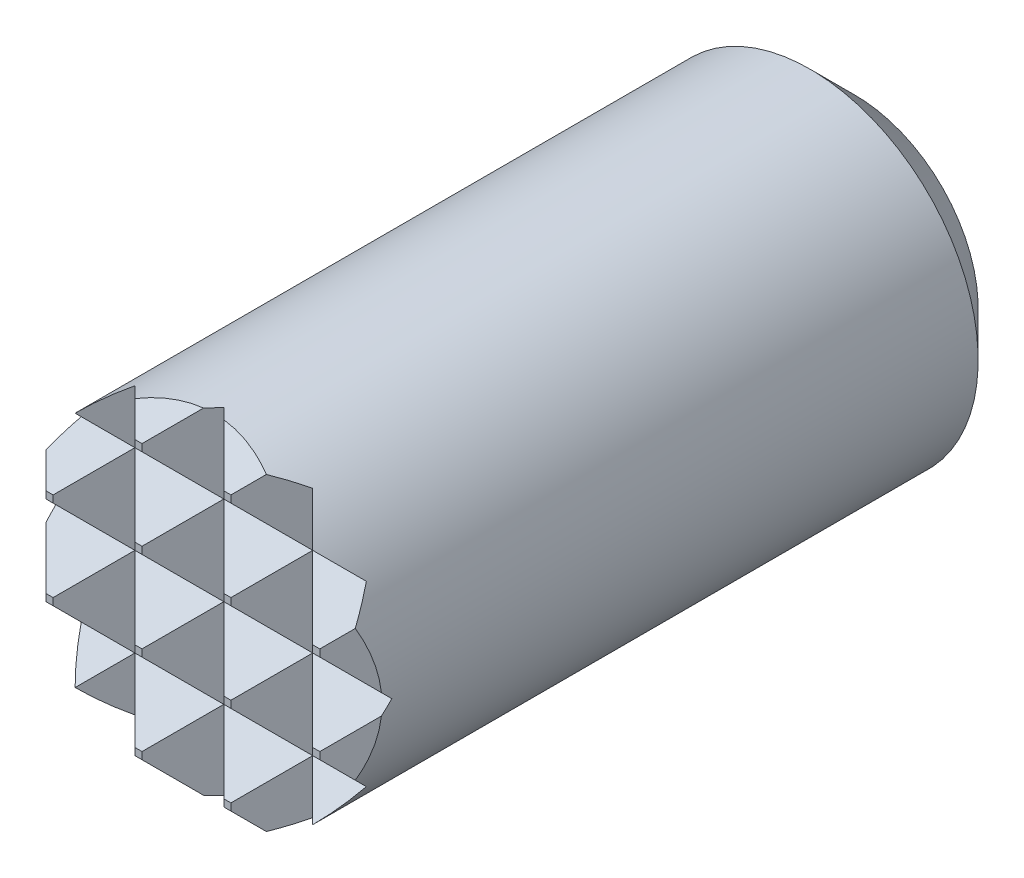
ISO-10303-21;
HEADER;
FILE_DESCRIPTION(('STEP AP214'),'2;1');
FILE_NAME('part.step','',(''),(''),'','','');
FILE_SCHEMA(('AUTOMOTIVE_DESIGN { 1 0 10303 214 1 1 1 1 }'));
ENDSEC;
DATA;
#1=APPLICATION_CONTEXT('core data for automotive mechanical design processes');
#2=APPLICATION_PROTOCOL_DEFINITION('international standard','automotive_design',2000,#1);
#3=PRODUCT_CONTEXT('',#1,'mechanical');
#4=PRODUCT('Part','Part','',(#3));
#5=PRODUCT_RELATED_PRODUCT_CATEGORY('part','',(#4));
#6=PRODUCT_DEFINITION_FORMATION('','',#4);
#7=PRODUCT_DEFINITION_CONTEXT('part definition',#1,'design');
#8=PRODUCT_DEFINITION('design','',#6,#7);
#9=PRODUCT_DEFINITION_SHAPE('','',#8);
#10=(LENGTH_UNIT() NAMED_UNIT(*) SI_UNIT(.MILLI.,.METRE.));
#11=(NAMED_UNIT(*) PLANE_ANGLE_UNIT() SI_UNIT($,.RADIAN.));
#12=(NAMED_UNIT(*) SI_UNIT($,.STERADIAN.) SOLID_ANGLE_UNIT());
#13=UNCERTAINTY_MEASURE_WITH_UNIT(LENGTH_MEASURE(1.E-05),#10,'distance_accuracy_value','');
#14=(GEOMETRIC_REPRESENTATION_CONTEXT(3) GLOBAL_UNCERTAINTY_ASSIGNED_CONTEXT((#13)) GLOBAL_UNIT_ASSIGNED_CONTEXT((#10,
#11,#12)) REPRESENTATION_CONTEXT('',''));
#15=CARTESIAN_POINT('',(0.,0.,0.));
#16=DIRECTION('',(0.,0.,1.));
#17=DIRECTION('',(1.,0.,0.));
#18=AXIS2_PLACEMENT_3D('',#15,#16,#17);
#19=CARTESIAN_POINT('',(0.,0.,12.));
#20=DIRECTION('',(0.,0.,1.));
#21=DIRECTION('',(1.,0.,0.));
#22=AXIS2_PLACEMENT_3D('',#19,#20,#21);
#23=PLANE('',#22);
#24=DIRECTION('',(0.,1.,0.));
#25=VECTOR('',#24,1.);
#26=CARTESIAN_POINT('',(-0.857250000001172,0.,12.));
#27=LINE('',#26,#25);
#28=CARTESIAN_POINT('',(-0.857250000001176,-0.857250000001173,12.));
#29=VERTEX_POINT('',#28);
#30=CARTESIAN_POINT('',(-0.857250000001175,-0.730249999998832,12.));
#31=VERTEX_POINT('',#30);
#32=EDGE_CURVE('E860',#29,#31,#27,.T.);
#33=ORIENTED_EDGE('',*,*,#32,.F.);
#34=DIRECTION('',(-1.,0.,0.));
#35=VECTOR('',#34,1.);
#36=CARTESIAN_POINT('',(0.,-0.857250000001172,12.));
#37=LINE('',#36,#35);
#38=CARTESIAN_POINT('',(-0.730249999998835,-0.857250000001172,12.));
#39=VERTEX_POINT('',#38);
#40=EDGE_CURVE('E321',#39,#29,#37,.T.);
#41=ORIENTED_EDGE('',*,*,#40,.F.);
#42=DIRECTION('',(0.,-1.,0.));
#43=VECTOR('',#42,1.);
#44=CARTESIAN_POINT('',(-0.730249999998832,0.,12.));
#45=LINE('',#44,#43);
#46=CARTESIAN_POINT('',(-0.730249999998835,-0.730249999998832,12.));
#47=VERTEX_POINT('',#46);
#48=EDGE_CURVE('E595',#47,#39,#45,.T.);
#49=ORIENTED_EDGE('',*,*,#48,.F.);
#50=DIRECTION('',(1.,0.,0.));
#51=VECTOR('',#50,1.);
#52=CARTESIAN_POINT('',(0.,-0.730249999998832,12.));
#53=LINE('',#52,#51);
#54=EDGE_CURVE('E512',#31,#47,#53,.T.);
#55=ORIENTED_EDGE('',*,*,#54,.F.);
#56=EDGE_LOOP('',(#33,#41,#49,#55));
#57=FACE_BOUND('',#56,.T.);
#58=ADVANCED_FACE('F15',(#57),#23,.T.);
#59=DIRECTION('',(0.,1.,0.));
#60=VECTOR('',#59,1.);
#61=CARTESIAN_POINT('',(-0.857250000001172,0.,12.));
#62=LINE('',#61,#60);
#63=CARTESIAN_POINT('',(-0.857250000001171,0.730249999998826,12.));
#64=VERTEX_POINT('',#63);
#65=CARTESIAN_POINT('',(-0.857250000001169,0.857250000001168,12.));
#66=VERTEX_POINT('',#65);
#67=EDGE_CURVE('E540',#64,#66,#62,.T.);
#68=ORIENTED_EDGE('',*,*,#67,.F.);
#69=DIRECTION('',(-1.,0.,0.));
#70=VECTOR('',#69,1.);
#71=CARTESIAN_POINT('',(0.,0.730249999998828,12.));
#72=LINE('',#71,#70);
#73=CARTESIAN_POINT('',(-0.73024999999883,0.730249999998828,12.));
#74=VERTEX_POINT('',#73);
#75=EDGE_CURVE('E519',#74,#64,#72,.T.);
#76=ORIENTED_EDGE('',*,*,#75,.F.);
#77=DIRECTION('',(0.,-1.,0.));
#78=VECTOR('',#77,1.);
#79=CARTESIAN_POINT('',(-0.730249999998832,0.,12.));
#80=LINE('',#79,#78);
#81=CARTESIAN_POINT('',(-0.730249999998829,0.857250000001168,12.));
#82=VERTEX_POINT('',#81);
#83=EDGE_CURVE('E539',#82,#74,#80,.T.);
#84=ORIENTED_EDGE('',*,*,#83,.F.);
#85=DIRECTION('',(1.,0.,0.));
#86=VECTOR('',#85,1.);
#87=CARTESIAN_POINT('',(0.,0.857250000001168,12.));
#88=LINE('',#87,#86);
#89=EDGE_CURVE('E505',#66,#82,#88,.T.);
#90=ORIENTED_EDGE('',*,*,#89,.F.);
#91=EDGE_LOOP('',(#68,#76,#84,#90));
#92=FACE_BOUND('',#91,.T.);
#93=ADVANCED_FACE('F537',(#92),#23,.T.);
#94=CARTESIAN_POINT('',(-3.,1.5875,11.2697500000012));
#95=DIRECTION('',(0.,0.707106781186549,-0.707106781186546));
#96=DIRECTION('',(0.,0.707106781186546,0.707106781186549));
#97=AXIS2_PLACEMENT_3D('',#94,#95,#96);
#98=PLANE('',#97);
#99=DIRECTION('',(-1.,0.,0.));
#100=VECTOR('',#99,1.);
#101=CARTESIAN_POINT('',(0.,2.31774999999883,12.));
#102=LINE('',#101,#100);
#103=CARTESIAN_POINT('',(-0.730249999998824,2.31774999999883,12.));
#104=VERTEX_POINT('',#103);
#105=CARTESIAN_POINT('',(-0.857250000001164,2.31774999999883,12.));
#106=VERTEX_POINT('',#105);
#107=EDGE_CURVE('E504',#104,#106,#102,.T.);
#108=ORIENTED_EDGE('',*,*,#107,.T.);
#109=DIRECTION('',(-0.577350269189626,-0.577350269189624,-0.577350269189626));
#110=VECTOR('',#109,1.);
#111=CARTESIAN_POINT('',(-2.05833333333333,1.11666666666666,10.7989166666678));
#112=LINE('',#111,#110);
#113=CARTESIAN_POINT('',(-1.5875,1.5875,11.2697500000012));
#114=VERTEX_POINT('',#113);
#115=EDGE_CURVE('E546',#106,#114,#112,.T.);
#116=ORIENTED_EDGE('',*,*,#115,.T.);
#117=DIRECTION('',(1.,0.,0.));
#118=VECTOR('',#117,1.);
#119=CARTESIAN_POINT('',(-3.,1.5875,11.2697500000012));
#120=LINE('',#119,#118);
#121=CARTESIAN_POINT('',(0.,1.5875,11.2697500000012));
#122=VERTEX_POINT('',#121);
#123=EDGE_CURVE('E488',#114,#122,#120,.T.);
#124=ORIENTED_EDGE('',*,*,#123,.T.);
#125=DIRECTION('',(-0.577350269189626,0.577350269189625,0.577350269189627));
#126=VECTOR('',#125,1.);
#127=CARTESIAN_POINT('',(-1.,2.5875,12.2697500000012));
#128=LINE('',#127,#126);
#129=EDGE_CURVE('E605',#122,#104,#128,.T.);
#130=ORIENTED_EDGE('',*,*,#129,.T.);
#131=EDGE_LOOP('',(#108,#116,#124,#130));
#132=FACE_BOUND('',#131,.T.);
#133=ADVANCED_FACE('F683',(#132),#98,.F.);
#134=CARTESIAN_POINT('',(-3.,0.79375,12.0635000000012));
#135=DIRECTION('',(0.,-0.707106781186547,-0.707106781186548));
#136=DIRECTION('',(0.,0.707106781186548,-0.707106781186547));
#137=AXIS2_PLACEMENT_3D('',#134,#135,#136);
#138=PLANE('',#137);
#139=ORIENTED_EDGE('',*,*,#123,.F.);
#140=DIRECTION('',(0.577350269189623,-0.577350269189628,0.577350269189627));
#141=VECTOR('',#140,1.);
#142=CARTESIAN_POINT('',(-1.52916666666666,1.52916666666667,11.3280833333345));
#143=LINE('',#142,#141);
#144=EDGE_CURVE('E544',#114,#66,#143,.T.);
#145=ORIENTED_EDGE('',*,*,#144,.T.);
#146=ORIENTED_EDGE('',*,*,#89,.T.);
#147=DIRECTION('',(0.577350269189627,0.577350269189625,-0.577350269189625));
#148=VECTOR('',#147,1.);
#149=CARTESIAN_POINT('',(-1.52916666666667,0.058333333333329,12.7989166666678));
#150=LINE('',#149,#148);
#151=EDGE_CURVE('E602',#82,#122,#150,.T.);
#152=ORIENTED_EDGE('',*,*,#151,.T.);
#153=EDGE_LOOP('',(#139,#145,#146,#152));
#154=FACE_BOUND('',#153,.T.);
#155=ADVANCED_FACE('F745',(#154),#138,.F.);
#156=CARTESIAN_POINT('',(-3.,0.,11.2697500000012));
#157=DIRECTION('',(0.,0.707106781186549,-0.707106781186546));
#158=DIRECTION('',(0.,0.707106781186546,0.707106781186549));
#159=AXIS2_PLACEMENT_3D('',#156,#157,#158);
#160=PLANE('',#159);
#161=ORIENTED_EDGE('',*,*,#75,.T.);
#162=DIRECTION('',(-0.577350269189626,-0.577350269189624,-0.577350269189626));
#163=VECTOR('',#162,1.);
#164=CARTESIAN_POINT('',(-2.05833333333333,-0.470833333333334,10.7989166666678));
#165=LINE('',#164,#163);
#166=CARTESIAN_POINT('',(-1.5875,0.,11.2697500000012));
#167=VERTEX_POINT('',#166);
#168=EDGE_CURVE('E530',#64,#167,#165,.T.);
#169=ORIENTED_EDGE('',*,*,#168,.T.);
#170=DIRECTION('',(1.,0.,0.));
#171=VECTOR('',#170,1.);
#172=CARTESIAN_POINT('',(-3.,0.,11.2697500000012));
#173=LINE('',#172,#171);
#174=CARTESIAN_POINT('',(0.,0.,11.2697500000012));
#175=VERTEX_POINT('',#174);
#176=EDGE_CURVE('E476',#167,#175,#173,.T.);
#177=ORIENTED_EDGE('',*,*,#176,.T.);
#178=DIRECTION('',(-0.577350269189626,0.577350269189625,0.577350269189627));
#179=VECTOR('',#178,1.);
#180=CARTESIAN_POINT('',(-1.,1.,12.2697500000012));
#181=LINE('',#180,#179);
#182=EDGE_CURVE('E533',#175,#74,#181,.T.);
#183=ORIENTED_EDGE('',*,*,#182,.T.);
#184=EDGE_LOOP('',(#161,#169,#177,#183));
#185=FACE_BOUND('',#184,.T.);
#186=ADVANCED_FACE('F529',(#185),#160,.F.);
#187=CARTESIAN_POINT('',(-3.,-0.79375,12.0635000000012));
#188=DIRECTION('',(0.,-0.707106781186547,-0.707106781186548));
#189=DIRECTION('',(0.,0.707106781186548,-0.707106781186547));
#190=AXIS2_PLACEMENT_3D('',#187,#188,#189);
#191=PLANE('',#190);
#192=ORIENTED_EDGE('',*,*,#176,.F.);
#193=DIRECTION('',(0.577350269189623,-0.577350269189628,0.577350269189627));
#194=VECTOR('',#193,1.);
#195=CARTESIAN_POINT('',(-1.52916666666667,-0.0583333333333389,11.3280833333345));
#196=LINE('',#195,#194);
#197=EDGE_CURVE('E548',#167,#31,#196,.T.);
#198=ORIENTED_EDGE('',*,*,#197,.T.);
#199=ORIENTED_EDGE('',*,*,#54,.T.);
#200=DIRECTION('',(0.577350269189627,0.577350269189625,-0.577350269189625));
#201=VECTOR('',#200,1.);
#202=CARTESIAN_POINT('',(-1.52916666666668,-1.52916666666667,12.7989166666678));
#203=LINE('',#202,#201);
#204=EDGE_CURVE('E597',#47,#175,#203,.T.);
#205=ORIENTED_EDGE('',*,*,#204,.T.);
#206=EDGE_LOOP('',(#192,#198,#199,#205));
#207=FACE_BOUND('',#206,.T.);
#208=ADVANCED_FACE('F867',(#207),#191,.F.);
#209=CARTESIAN_POINT('',(-3.,-1.5875,11.2697500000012));
#210=DIRECTION('',(0.,0.707106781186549,-0.707106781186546));
#211=DIRECTION('',(0.,0.707106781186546,0.707106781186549));
#212=AXIS2_PLACEMENT_3D('',#209,#210,#211);
#213=PLANE('',#212);
#214=ORIENTED_EDGE('',*,*,#40,.T.);
#215=DIRECTION('',(-0.577350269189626,-0.577350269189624,-0.577350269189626));
#216=VECTOR('',#215,1.);
#217=CARTESIAN_POINT('',(-2.05833333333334,-2.05833333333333,10.7989166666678));
#218=LINE('',#217,#216);
#219=CARTESIAN_POINT('',(-1.5875,-1.5875,11.2697500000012));
#220=VERTEX_POINT('',#219);
#221=EDGE_CURVE('E810',#29,#220,#218,.T.);
#222=ORIENTED_EDGE('',*,*,#221,.T.);
#223=DIRECTION('',(1.,0.,0.));
#224=VECTOR('',#223,1.);
#225=CARTESIAN_POINT('',(-3.,-1.5875,11.2697500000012));
#226=LINE('',#225,#224);
#227=CARTESIAN_POINT('',(0.,-1.5875,11.2697500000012));
#228=VERTEX_POINT('',#227);
#229=EDGE_CURVE('E465',#220,#228,#226,.T.);
#230=ORIENTED_EDGE('',*,*,#229,.T.);
#231=DIRECTION('',(-0.577350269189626,0.577350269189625,0.577350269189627));
#232=VECTOR('',#231,1.);
#233=CARTESIAN_POINT('',(-1.,-0.5875,12.2697500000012));
#234=LINE('',#233,#232);
#235=EDGE_CURVE('E592',#228,#39,#234,.T.);
#236=ORIENTED_EDGE('',*,*,#235,.T.);
#237=EDGE_LOOP('',(#214,#222,#230,#236));
#238=FACE_BOUND('',#237,.T.);
#239=ADVANCED_FACE('F878',(#238),#213,.F.);
#240=CARTESIAN_POINT('',(-3.,-2.38125,12.0635000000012));
#241=DIRECTION('',(0.,-0.707106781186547,-0.707106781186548));
#242=DIRECTION('',(0.,0.707106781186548,-0.707106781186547));
#243=AXIS2_PLACEMENT_3D('',#240,#241,#242);
#244=PLANE('',#243);
#245=ORIENTED_EDGE('',*,*,#229,.F.);
#246=DIRECTION('',(0.577350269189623,-0.577350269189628,0.577350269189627));
#247=VECTOR('',#246,1.);
#248=CARTESIAN_POINT('',(-1.52916666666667,-1.64583333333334,11.3280833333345));
#249=LINE('',#248,#247);
#250=CARTESIAN_POINT('',(-0.85725000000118,-2.31774999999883,12.));
#251=VERTEX_POINT('',#250);
#252=EDGE_CURVE('E806',#220,#251,#249,.T.);
#253=ORIENTED_EDGE('',*,*,#252,.T.);
#254=DIRECTION('',(1.,0.,0.));
#255=VECTOR('',#254,1.);
#256=CARTESIAN_POINT('',(0.,-2.31774999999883,12.));
#257=LINE('',#256,#255);
#258=CARTESIAN_POINT('',(-0.730249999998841,-2.31774999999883,12.));
#259=VERTEX_POINT('',#258);
#260=EDGE_CURVE('E322',#251,#259,#257,.T.);
#261=ORIENTED_EDGE('',*,*,#260,.T.);
#262=DIRECTION('',(0.577350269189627,0.577350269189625,-0.577350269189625));
#263=VECTOR('',#262,1.);
#264=CARTESIAN_POINT('',(-1.52916666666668,-3.11666666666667,12.7989166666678));
#265=LINE('',#264,#263);
#266=EDGE_CURVE('E589',#259,#228,#265,.T.);
#267=ORIENTED_EDGE('',*,*,#266,.T.);
#268=EDGE_LOOP('',(#245,#253,#261,#267));
#269=FACE_BOUND('',#268,.T.);
#270=ADVANCED_FACE('F916',(#269),#244,.F.);
#271=DIRECTION('',(0.,1.,0.));
#272=VECTOR('',#271,1.);
#273=CARTESIAN_POINT('',(0.730249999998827,0.,12.));
#274=LINE('',#273,#272);
#275=CARTESIAN_POINT('',(0.730249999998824,-0.857250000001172,12.));
#276=VERTEX_POINT('',#275);
#277=CARTESIAN_POINT('',(0.730249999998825,-0.730249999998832,12.));
#278=VERTEX_POINT('',#277);
#279=EDGE_CURVE('E354',#276,#278,#274,.T.);
#280=ORIENTED_EDGE('',*,*,#279,.F.);
#281=CARTESIAN_POINT('',(0.857250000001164,-0.857250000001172,12.));
#282=VERTEX_POINT('',#281);
#283=EDGE_CURVE('E326',#282,#276,#37,.T.);
#284=ORIENTED_EDGE('',*,*,#283,.F.);
#285=DIRECTION('',(0.,-1.,0.));
#286=VECTOR('',#285,1.);
#287=CARTESIAN_POINT('',(0.857250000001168,0.,12.));
#288=LINE('',#287,#286);
#289=CARTESIAN_POINT('',(0.857250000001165,-0.730249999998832,12.));
#290=VERTEX_POINT('',#289);
#291=EDGE_CURVE('E353',#290,#282,#288,.T.);
#292=ORIENTED_EDGE('',*,*,#291,.F.);
#293=EDGE_CURVE('E355',#278,#290,#53,.T.);
#294=ORIENTED_EDGE('',*,*,#293,.F.);
#295=EDGE_LOOP('',(#280,#284,#292,#294));
#296=FACE_BOUND('',#295,.T.);
#297=ADVANCED_FACE('F351',(#296),#23,.T.);
#298=DIRECTION('',(0.,1.,0.));
#299=VECTOR('',#298,1.);
#300=CARTESIAN_POINT('',(0.730249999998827,0.,12.));
#301=LINE('',#300,#299);
#302=CARTESIAN_POINT('',(0.73024999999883,0.730249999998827,12.));
#303=VERTEX_POINT('',#302);
#304=CARTESIAN_POINT('',(0.730249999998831,0.857250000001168,12.));
#305=VERTEX_POINT('',#304);
#306=EDGE_CURVE('E369',#303,#305,#301,.T.);
#307=ORIENTED_EDGE('',*,*,#306,.F.);
#308=CARTESIAN_POINT('',(0.85725000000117,0.730249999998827,12.));
#309=VERTEX_POINT('',#308);
#310=EDGE_CURVE('E515',#309,#303,#72,.T.);
#311=ORIENTED_EDGE('',*,*,#310,.F.);
#312=DIRECTION('',(0.,-1.,0.));
#313=VECTOR('',#312,1.);
#314=CARTESIAN_POINT('',(0.857250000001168,0.,12.));
#315=LINE('',#314,#313);
#316=CARTESIAN_POINT('',(0.857250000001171,0.857250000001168,12.));
#317=VERTEX_POINT('',#316);
#318=EDGE_CURVE('E405',#317,#309,#315,.T.);
#319=ORIENTED_EDGE('',*,*,#318,.F.);
#320=EDGE_CURVE('E746',#305,#317,#88,.T.);
#321=ORIENTED_EDGE('',*,*,#320,.F.);
#322=EDGE_LOOP('',(#307,#311,#319,#321));
#323=FACE_BOUND('',#322,.T.);
#324=ADVANCED_FACE('F953',(#323),#23,.T.);
#325=DIRECTION('',(0.,1.,0.));
#326=VECTOR('',#325,1.);
#327=CARTESIAN_POINT('',(0.730249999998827,0.,12.));
#328=LINE('',#327,#326);
#329=CARTESIAN_POINT('',(0.730249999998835,2.31774999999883,12.));
#330=VERTEX_POINT('',#329);
#331=CARTESIAN_POINT('',(0.730249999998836,2.44475000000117,12.));
#332=VERTEX_POINT('',#331);
#333=EDGE_CURVE('E377',#330,#332,#328,.T.);
#334=ORIENTED_EDGE('',*,*,#333,.F.);
#335=CARTESIAN_POINT('',(0.857250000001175,2.31774999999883,12.));
#336=VERTEX_POINT('',#335);
#337=EDGE_CURVE('E506',#336,#330,#102,.T.);
#338=ORIENTED_EDGE('',*,*,#337,.F.);
#339=DIRECTION('',(0.,-1.,0.));
#340=VECTOR('',#339,1.);
#341=CARTESIAN_POINT('',(0.857250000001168,0.,12.));
#342=LINE('',#341,#340);
#343=CARTESIAN_POINT('',(0.857250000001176,2.44475000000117,12.));
#344=VERTEX_POINT('',#343);
#345=EDGE_CURVE('E413',#344,#336,#342,.T.);
#346=ORIENTED_EDGE('',*,*,#345,.F.);
#347=DIRECTION('',(1.,0.,0.));
#348=VECTOR('',#347,1.);
#349=CARTESIAN_POINT('',(0.,2.44475000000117,12.));
#350=LINE('',#349,#348);
#351=EDGE_CURVE('E497',#332,#344,#350,.T.);
#352=ORIENTED_EDGE('',*,*,#351,.F.);
#353=EDGE_LOOP('',(#334,#338,#346,#352));
#354=FACE_BOUND('',#353,.T.);
#355=ADVANCED_FACE('F949',(#354),#23,.T.);
#356=DIRECTION('',(0.,1.,0.));
#357=VECTOR('',#356,1.);
#358=CARTESIAN_POINT('',(0.730249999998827,0.,12.));
#359=LINE('',#358,#357);
#360=CARTESIAN_POINT('',(0.730249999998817,-2.44475000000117,12.));
#361=VERTEX_POINT('',#360);
#362=CARTESIAN_POINT('',(0.730249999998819,-2.31774999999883,12.));
#363=VERTEX_POINT('',#362);
#364=EDGE_CURVE('E613',#361,#363,#359,.T.);
#365=ORIENTED_EDGE('',*,*,#364,.F.);
#366=DIRECTION('',(-1.,0.,0.));
#367=VECTOR('',#366,1.);
#368=CARTESIAN_POINT('',(0.,-2.44475000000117,12.));
#369=LINE('',#368,#367);
#370=CARTESIAN_POINT('',(0.857250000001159,-2.44475000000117,12.));
#371=VERTEX_POINT('',#370);
#372=EDGE_CURVE('E337',#371,#361,#369,.T.);
#373=ORIENTED_EDGE('',*,*,#372,.F.);
#374=DIRECTION('',(0.,-1.,0.));
#375=VECTOR('',#374,1.);
#376=CARTESIAN_POINT('',(0.857250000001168,0.,12.));
#377=LINE('',#376,#375);
#378=CARTESIAN_POINT('',(0.857250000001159,-2.31774999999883,12.));
#379=VERTEX_POINT('',#378);
#380=EDGE_CURVE('E388',#379,#371,#377,.T.);
#381=ORIENTED_EDGE('',*,*,#380,.F.);
#382=EDGE_CURVE('E327',#363,#379,#257,.T.);
#383=ORIENTED_EDGE('',*,*,#382,.F.);
#384=EDGE_LOOP('',(#365,#373,#381,#383));
#385=FACE_BOUND('',#384,.T.);
#386=ADVANCED_FACE('F631',(#385),#23,.T.);
#387=CARTESIAN_POINT('',(-3.,2.38125,12.0635000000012));
#388=DIRECTION('',(0.,-0.707106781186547,-0.707106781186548));
#389=DIRECTION('',(0.,0.707106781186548,-0.707106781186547));
#390=AXIS2_PLACEMENT_3D('',#387,#388,#389);
#391=PLANE('',#390);
#392=CARTESIAN_POINT('',(0.,0.,14.4447500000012));
#393=DIRECTION('',(0.,-0.707106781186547,-0.707106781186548));
#394=DIRECTION('',(0.,0.707106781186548,-0.707106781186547));
#395=AXIS2_PLACEMENT_3D('',#392,#393,#394);
#396=ELLIPSE('',#395,4.24264068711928,3.);
#397=CARTESIAN_POINT('',(0.180430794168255,2.99456920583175,11.4501807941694));
#398=VERTEX_POINT('',#397);
#399=CARTESIAN_POINT('',(1.17347162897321,2.76097162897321,11.683778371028));
#400=VERTEX_POINT('',#399);
#401=EDGE_CURVE('E498',#398,#400,#396,.T.);
#402=ORIENTED_EDGE('',*,*,#401,.F.);
#403=DIRECTION('',(0.577350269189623,-0.577350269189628,0.577350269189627));
#404=VECTOR('',#403,1.);
#405=CARTESIAN_POINT('',(-0.470833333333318,3.64583333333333,10.7989166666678));
#406=LINE('',#405,#404);
#407=EDGE_CURVE('E379',#398,#332,#406,.T.);
#408=ORIENTED_EDGE('',*,*,#407,.T.);
#409=ORIENTED_EDGE('',*,*,#351,.T.);
#410=DIRECTION('',(0.577350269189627,0.577350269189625,-0.577350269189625));
#411=VECTOR('',#410,1.);
#412=CARTESIAN_POINT('',(-0.470833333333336,1.11666666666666,13.3280833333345));
#413=LINE('',#412,#411);
#414=EDGE_CURVE('E415',#344,#400,#413,.T.);
#415=ORIENTED_EDGE('',*,*,#414,.T.);
#416=EDGE_LOOP('',(#402,#408,#409,#415));
#417=FACE_BOUND('',#416,.T.);
#418=ADVANCED_FACE('F697',(#417),#391,.F.);
#419=ORIENTED_EDGE('',*,*,#337,.T.);
#420=DIRECTION('',(-0.577350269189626,-0.577350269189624,-0.577350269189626));
#421=VECTOR('',#420,1.);
#422=CARTESIAN_POINT('',(-1.,0.5875,10.2697500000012));
#423=LINE('',#422,#421);
#424=EDGE_CURVE('E374',#330,#122,#423,.T.);
#425=ORIENTED_EDGE('',*,*,#424,.T.);
#426=CARTESIAN_POINT('',(1.5875,1.5875,11.2697500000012));
#427=VERTEX_POINT('',#426);
#428=EDGE_CURVE('E735',#122,#427,#120,.T.);
#429=ORIENTED_EDGE('',*,*,#428,.T.);
#430=DIRECTION('',(-0.577350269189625,0.577350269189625,0.577350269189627));
#431=VECTOR('',#430,1.);
#432=CARTESIAN_POINT('',(0.0583333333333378,3.11666666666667,12.7989166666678));
#433=LINE('',#432,#431);
#434=EDGE_CURVE('E410',#427,#336,#433,.T.);
#435=ORIENTED_EDGE('',*,*,#434,.T.);
#436=EDGE_LOOP('',(#419,#425,#429,#435));
#437=FACE_BOUND('',#436,.T.);
#438=ADVANCED_FACE('F740',(#437),#98,.F.);
#439=ORIENTED_EDGE('',*,*,#428,.F.);
#440=DIRECTION('',(0.577350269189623,-0.577350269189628,0.577350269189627));
#441=VECTOR('',#440,1.);
#442=CARTESIAN_POINT('',(-0.470833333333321,2.05833333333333,10.7989166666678));
#443=LINE('',#442,#441);
#444=EDGE_CURVE('E371',#122,#305,#443,.T.);
#445=ORIENTED_EDGE('',*,*,#444,.T.);
#446=ORIENTED_EDGE('',*,*,#320,.T.);
#447=DIRECTION('',(0.577350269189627,0.577350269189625,-0.577350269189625));
#448=VECTOR('',#447,1.);
#449=CARTESIAN_POINT('',(-0.47083333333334,-0.470833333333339,13.3280833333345));
#450=LINE('',#449,#448);
#451=EDGE_CURVE('E407',#317,#427,#450,.T.);
#452=ORIENTED_EDGE('',*,*,#451,.T.);
#453=EDGE_LOOP('',(#439,#445,#446,#452));
#454=FACE_BOUND('',#453,.T.);
#455=ADVANCED_FACE('F736',(#454),#138,.F.);
#456=ORIENTED_EDGE('',*,*,#310,.T.);
#457=DIRECTION('',(-0.577350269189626,-0.577350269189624,-0.577350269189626));
#458=VECTOR('',#457,1.);
#459=CARTESIAN_POINT('',(-1.,-1.,10.2697500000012));
#460=LINE('',#459,#458);
#461=EDGE_CURVE('E361',#303,#175,#460,.T.);
#462=ORIENTED_EDGE('',*,*,#461,.T.);
#463=CARTESIAN_POINT('',(1.5875,0.,11.2697500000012));
#464=VERTEX_POINT('',#463);
#465=EDGE_CURVE('E775',#175,#464,#173,.T.);
#466=ORIENTED_EDGE('',*,*,#465,.T.);
#467=DIRECTION('',(-0.577350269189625,0.577350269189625,0.577350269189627));
#468=VECTOR('',#467,1.);
#469=CARTESIAN_POINT('',(0.0583333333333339,1.52916666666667,12.7989166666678));
#470=LINE('',#469,#468);
#471=EDGE_CURVE('E402',#464,#309,#470,.T.);
#472=ORIENTED_EDGE('',*,*,#471,.T.);
#473=EDGE_LOOP('',(#456,#462,#466,#472));
#474=FACE_BOUND('',#473,.T.);
#475=ADVANCED_FACE('F945',(#474),#160,.F.);
#476=ORIENTED_EDGE('',*,*,#465,.F.);
#477=DIRECTION('',(0.577350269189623,-0.577350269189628,0.577350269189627));
#478=VECTOR('',#477,1.);
#479=CARTESIAN_POINT('',(-0.470833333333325,0.470833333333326,10.7989166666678));
#480=LINE('',#479,#478);
#481=EDGE_CURVE('E359',#175,#278,#480,.T.);
#482=ORIENTED_EDGE('',*,*,#481,.T.);
#483=ORIENTED_EDGE('',*,*,#293,.T.);
#484=DIRECTION('',(0.577350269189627,0.577350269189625,-0.577350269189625));
#485=VECTOR('',#484,1.);
#486=CARTESIAN_POINT('',(-0.470833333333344,-2.05833333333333,13.3280833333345));
#487=LINE('',#486,#485);
#488=EDGE_CURVE('E399',#290,#464,#487,.T.);
#489=ORIENTED_EDGE('',*,*,#488,.T.);
#490=EDGE_LOOP('',(#476,#482,#483,#489));
#491=FACE_BOUND('',#490,.T.);
#492=ADVANCED_FACE('F774',(#491),#191,.F.);
#493=ORIENTED_EDGE('',*,*,#283,.T.);
#494=DIRECTION('',(-0.577350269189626,-0.577350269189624,-0.577350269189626));
#495=VECTOR('',#494,1.);
#496=CARTESIAN_POINT('',(-1.,-2.5875,10.2697500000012));
#497=LINE('',#496,#495);
#498=EDGE_CURVE('E344',#276,#228,#497,.T.);
#499=ORIENTED_EDGE('',*,*,#498,.T.);
#500=CARTESIAN_POINT('',(1.5875,-1.5875,11.2697500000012));
#501=VERTEX_POINT('',#500);
#502=EDGE_CURVE('E624',#228,#501,#226,.T.);
#503=ORIENTED_EDGE('',*,*,#502,.T.);
#504=DIRECTION('',(-0.577350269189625,0.577350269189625,0.577350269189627));
#505=VECTOR('',#504,1.);
#506=CARTESIAN_POINT('',(0.0583333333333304,-0.0583333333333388,12.7989166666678));
#507=LINE('',#506,#505);
#508=EDGE_CURVE('E347',#501,#282,#507,.T.);
#509=ORIENTED_EDGE('',*,*,#508,.T.);
#510=EDGE_LOOP('',(#493,#499,#503,#509));
#511=FACE_BOUND('',#510,.T.);
#512=ADVANCED_FACE('F343',(#511),#213,.F.);
#513=ORIENTED_EDGE('',*,*,#502,.F.);
#514=DIRECTION('',(0.577350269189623,-0.577350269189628,0.577350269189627));
#515=VECTOR('',#514,1.);
#516=CARTESIAN_POINT('',(-0.470833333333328,-1.11666666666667,10.7989166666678));
#517=LINE('',#516,#515);
#518=EDGE_CURVE('E363',#228,#363,#517,.T.);
#519=ORIENTED_EDGE('',*,*,#518,.T.);
#520=ORIENTED_EDGE('',*,*,#382,.T.);
#521=DIRECTION('',(0.577350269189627,0.577350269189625,-0.577350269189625));
#522=VECTOR('',#521,1.);
#523=CARTESIAN_POINT('',(-0.470833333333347,-3.64583333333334,13.3280833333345));
#524=LINE('',#523,#522);
#525=EDGE_CURVE('E393',#379,#501,#524,.T.);
#526=ORIENTED_EDGE('',*,*,#525,.T.);
#527=EDGE_LOOP('',(#513,#519,#520,#526));
#528=FACE_BOUND('',#527,.T.);
#529=ADVANCED_FACE('F622',(#528),#244,.F.);
#530=CARTESIAN_POINT('',(-3.,-3.175,11.2697500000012));
#531=DIRECTION('',(0.,0.707106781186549,-0.707106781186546));
#532=DIRECTION('',(0.,0.707106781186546,0.707106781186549));
#533=AXIS2_PLACEMENT_3D('',#530,#531,#532);
#534=PLANE('',#533);
#535=ORIENTED_EDGE('',*,*,#372,.T.);
#536=DIRECTION('',(-0.577350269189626,-0.577350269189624,-0.577350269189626));
#537=VECTOR('',#536,1.);
#538=CARTESIAN_POINT('',(-1.,-4.175,10.2697500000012));
#539=LINE('',#538,#537);
#540=CARTESIAN_POINT('',(0.180430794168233,-2.99456920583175,11.4501807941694));
#541=VERTEX_POINT('',#540);
#542=EDGE_CURVE('E653',#361,#541,#539,.T.);
#543=ORIENTED_EDGE('',*,*,#542,.T.);
#544=CARTESIAN_POINT('',(0.,0.,14.4447500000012));
#545=DIRECTION('',(0.,0.707106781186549,-0.707106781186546));
#546=DIRECTION('',(0.,-0.707106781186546,-0.707106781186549));
#547=AXIS2_PLACEMENT_3D('',#544,#545,#546);
#548=ELLIPSE('',#547,4.24264068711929,3.);
#549=CARTESIAN_POINT('',(1.1734716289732,-2.76097162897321,11.683778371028));
#550=VERTEX_POINT('',#549);
#551=EDGE_CURVE('E458',#550,#541,#548,.T.);
#552=ORIENTED_EDGE('',*,*,#551,.F.);
#553=DIRECTION('',(-0.577350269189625,0.577350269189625,0.577350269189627));
#554=VECTOR('',#553,1.);
#555=CARTESIAN_POINT('',(0.0583333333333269,-1.64583333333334,12.7989166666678));
#556=LINE('',#555,#554);
#557=EDGE_CURVE('E637',#550,#371,#556,.T.);
#558=ORIENTED_EDGE('',*,*,#557,.T.);
#559=EDGE_LOOP('',(#535,#543,#552,#558));
#560=FACE_BOUND('',#559,.T.);
#561=ADVANCED_FACE('F641',(#560),#534,.F.);
#562=DIRECTION('',(0.,1.,0.));
#563=VECTOR('',#562,1.);
#564=CARTESIAN_POINT('',(2.31774999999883,0.,12.));
#565=LINE('',#564,#563);
#566=CARTESIAN_POINT('',(2.31774999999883,-0.857250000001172,12.));
#567=VERTEX_POINT('',#566);
#568=CARTESIAN_POINT('',(2.31774999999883,-0.730249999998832,12.));
#569=VERTEX_POINT('',#568);
#570=EDGE_CURVE('E423',#567,#569,#565,.T.);
#571=ORIENTED_EDGE('',*,*,#570,.F.);
#572=CARTESIAN_POINT('',(2.44475000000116,-0.857250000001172,12.));
#573=VERTEX_POINT('',#572);
#574=EDGE_CURVE('E324',#573,#567,#37,.T.);
#575=ORIENTED_EDGE('',*,*,#574,.F.);
#576=DIRECTION('',(0.,-1.,0.));
#577=VECTOR('',#576,1.);
#578=CARTESIAN_POINT('',(2.44475000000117,0.,12.));
#579=LINE('',#578,#577);
#580=CARTESIAN_POINT('',(2.44475000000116,-0.730249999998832,12.));
#581=VERTEX_POINT('',#580);
#582=EDGE_CURVE('E443',#581,#573,#579,.T.);
#583=ORIENTED_EDGE('',*,*,#582,.F.);
#584=EDGE_CURVE('E509',#569,#581,#53,.T.);
#585=ORIENTED_EDGE('',*,*,#584,.F.);
#586=EDGE_LOOP('',(#571,#575,#583,#585));
#587=FACE_BOUND('',#586,.T.);
#588=ADVANCED_FACE('F896',(#587),#23,.T.);
#589=DIRECTION('',(0.,1.,0.));
#590=VECTOR('',#589,1.);
#591=CARTESIAN_POINT('',(2.31774999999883,0.,12.));
#592=LINE('',#591,#590);
#593=CARTESIAN_POINT('',(2.31774999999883,0.730249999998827,12.));
#594=VERTEX_POINT('',#593);
#595=CARTESIAN_POINT('',(2.31774999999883,0.857250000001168,12.));
#596=VERTEX_POINT('',#595);
#597=EDGE_CURVE('E432',#594,#596,#592,.T.);
#598=ORIENTED_EDGE('',*,*,#597,.F.);
#599=CARTESIAN_POINT('',(2.44475000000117,0.730249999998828,12.));
#600=VERTEX_POINT('',#599);
#601=EDGE_CURVE('E513',#600,#594,#72,.T.);
#602=ORIENTED_EDGE('',*,*,#601,.F.);
#603=DIRECTION('',(0.,-1.,0.));
#604=VECTOR('',#603,1.);
#605=CARTESIAN_POINT('',(2.44475000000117,0.,12.));
#606=LINE('',#605,#604);
#607=CARTESIAN_POINT('',(2.44475000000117,0.857250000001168,12.));
#608=VERTEX_POINT('',#607);
#609=EDGE_CURVE('E452',#608,#600,#606,.T.);
#610=ORIENTED_EDGE('',*,*,#609,.F.);
#611=EDGE_CURVE('E501',#596,#608,#88,.T.);
#612=ORIENTED_EDGE('',*,*,#611,.F.);
#613=EDGE_LOOP('',(#598,#602,#610,#612));
#614=FACE_BOUND('',#613,.T.);
#615=ADVANCED_FACE('F761',(#614),#23,.T.);
#616=CARTESIAN_POINT('',(0.,0.,9.68225000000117));
#617=DIRECTION('',(0.,0.707106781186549,-0.707106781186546));
#618=DIRECTION('',(0.,-0.707106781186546,-0.707106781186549));
#619=AXIS2_PLACEMENT_3D('',#616,#617,#618);
#620=ELLIPSE('',#619,4.24264068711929,3.);
#621=CARTESIAN_POINT('',(2.12132034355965,2.12132034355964,11.8035703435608));
#622=VERTEX_POINT('',#621);
#623=CARTESIAN_POINT('',(2.54555372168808,1.5875,11.2697500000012));
#624=VERTEX_POINT('',#623);
#625=EDGE_CURVE('E492',#622,#624,#620,.T.);
#626=ORIENTED_EDGE('',*,*,#625,.F.);
#627=DIRECTION('',(-0.577350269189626,-0.577350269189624,-0.577350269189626));
#628=VECTOR('',#627,1.);
#629=CARTESIAN_POINT('',(0.0583333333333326,0.0583333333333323,9.7405833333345));
#630=LINE('',#629,#628);
#631=EDGE_CURVE('E437',#622,#427,#630,.T.);
#632=ORIENTED_EDGE('',*,*,#631,.T.);
#633=EDGE_CURVE('E489',#427,#624,#120,.T.);
#634=ORIENTED_EDGE('',*,*,#633,.T.);
#635=EDGE_LOOP('',(#626,#632,#634));
#636=FACE_BOUND('',#635,.T.);
#637=ADVANCED_FACE('F929',(#636),#98,.F.);
#638=ORIENTED_EDGE('',*,*,#633,.F.);
#639=DIRECTION('',(0.577350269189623,-0.577350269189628,0.577350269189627));
#640=VECTOR('',#639,1.);
#641=CARTESIAN_POINT('',(0.587500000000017,2.5875,10.2697500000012));
#642=LINE('',#641,#640);
#643=EDGE_CURVE('E434',#427,#596,#642,.T.);
#644=ORIENTED_EDGE('',*,*,#643,.T.);
#645=ORIENTED_EDGE('',*,*,#611,.T.);
#646=DIRECTION('',(0.577350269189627,0.577350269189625,-0.577350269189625));
#647=VECTOR('',#646,1.);
#648=CARTESIAN_POINT('',(0.587499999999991,-1.,13.8572500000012));
#649=LINE('',#648,#647);
#650=CARTESIAN_POINT('',(2.76097162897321,1.1734716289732,11.683778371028));
#651=VERTEX_POINT('',#650);
#652=EDGE_CURVE('E454',#608,#651,#649,.T.);
#653=ORIENTED_EDGE('',*,*,#652,.T.);
#654=CARTESIAN_POINT('',(0.,0.,12.8572500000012));
#655=DIRECTION('',(0.,-0.707106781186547,-0.707106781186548));
#656=DIRECTION('',(0.,0.707106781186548,-0.707106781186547));
#657=AXIS2_PLACEMENT_3D('',#654,#655,#656);
#658=ELLIPSE('',#657,4.24264068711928,3.);
#659=EDGE_CURVE('E491',#624,#651,#658,.T.);
#660=ORIENTED_EDGE('',*,*,#659,.F.);
#661=EDGE_LOOP('',(#638,#644,#645,#653,#660));
#662=FACE_BOUND('',#661,.T.);
#663=ADVANCED_FACE('F751',(#662),#138,.F.);
#664=ORIENTED_EDGE('',*,*,#601,.T.);
#665=DIRECTION('',(-0.577350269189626,-0.577350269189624,-0.577350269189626));
#666=VECTOR('',#665,1.);
#667=CARTESIAN_POINT('',(0.0583333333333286,-1.52916666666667,9.7405833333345));
#668=LINE('',#667,#666);
#669=EDGE_CURVE('E429',#594,#464,#668,.T.);
#670=ORIENTED_EDGE('',*,*,#669,.T.);
#671=CARTESIAN_POINT('',(3.,0.,11.2697500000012));
#672=VERTEX_POINT('',#671);
#673=EDGE_CURVE('E477',#464,#672,#173,.T.);
#674=ORIENTED_EDGE('',*,*,#673,.T.);
#675=CARTESIAN_POINT('',(0.,0.,11.2697500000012));
#676=DIRECTION('',(0.,0.707106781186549,-0.707106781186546));
#677=DIRECTION('',(0.,-0.707106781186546,-0.707106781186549));
#678=AXIS2_PLACEMENT_3D('',#675,#676,#677);
#679=ELLIPSE('',#678,4.24264068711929,3.);
#680=CARTESIAN_POINT('',(2.99456920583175,0.180430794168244,11.4501807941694));
#681=VERTEX_POINT('',#680);
#682=EDGE_CURVE('E480',#681,#672,#679,.T.);
#683=ORIENTED_EDGE('',*,*,#682,.F.);
#684=DIRECTION('',(-0.577350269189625,0.577350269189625,0.577350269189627));
#685=VECTOR('',#684,1.);
#686=CARTESIAN_POINT('',(1.11666666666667,2.05833333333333,13.3280833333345));
#687=LINE('',#686,#685);
#688=EDGE_CURVE('E449',#681,#600,#687,.T.);
#689=ORIENTED_EDGE('',*,*,#688,.T.);
#690=EDGE_LOOP('',(#664,#670,#674,#683,#689));
#691=FACE_BOUND('',#690,.T.);
#692=ADVANCED_FACE('F768',(#691),#160,.F.);
#693=ORIENTED_EDGE('',*,*,#673,.F.);
#694=DIRECTION('',(0.577350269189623,-0.577350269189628,0.577350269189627));
#695=VECTOR('',#694,1.);
#696=CARTESIAN_POINT('',(0.587500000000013,1.,10.2697500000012));
#697=LINE('',#696,#695);
#698=EDGE_CURVE('E426',#464,#569,#697,.T.);
#699=ORIENTED_EDGE('',*,*,#698,.T.);
#700=ORIENTED_EDGE('',*,*,#584,.T.);
#701=DIRECTION('',(0.577350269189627,0.577350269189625,-0.577350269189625));
#702=VECTOR('',#701,1.);
#703=CARTESIAN_POINT('',(0.587499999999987,-2.5875,13.8572500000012));
#704=LINE('',#703,#702);
#705=CARTESIAN_POINT('',(2.99456920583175,-0.180430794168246,11.4501807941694));
#706=VERTEX_POINT('',#705);
#707=EDGE_CURVE('E446',#581,#706,#704,.T.);
#708=ORIENTED_EDGE('',*,*,#707,.T.);
#709=CARTESIAN_POINT('',(0.,0.,11.2697500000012));
#710=DIRECTION('',(0.,-0.707106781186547,-0.707106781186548));
#711=DIRECTION('',(0.,0.707106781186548,-0.707106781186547));
#712=AXIS2_PLACEMENT_3D('',#709,#710,#711);
#713=ELLIPSE('',#712,4.24264068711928,3.);
#714=EDGE_CURVE('E479',#672,#706,#713,.T.);
#715=ORIENTED_EDGE('',*,*,#714,.F.);
#716=EDGE_LOOP('',(#693,#699,#700,#708,#715));
#717=FACE_BOUND('',#716,.T.);
#718=ADVANCED_FACE('F785',(#717),#191,.F.);
#719=ORIENTED_EDGE('',*,*,#574,.T.);
#720=DIRECTION('',(-0.577350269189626,-0.577350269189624,-0.577350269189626));
#721=VECTOR('',#720,1.);
#722=CARTESIAN_POINT('',(0.0583333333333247,-3.11666666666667,9.7405833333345));
#723=LINE('',#722,#721);
#724=EDGE_CURVE('E418',#567,#501,#723,.T.);
#725=ORIENTED_EDGE('',*,*,#724,.T.);
#726=CARTESIAN_POINT('',(2.54555372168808,-1.5875,11.2697500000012));
#727=VERTEX_POINT('',#726);
#728=EDGE_CURVE('E461',#501,#727,#226,.T.);
#729=ORIENTED_EDGE('',*,*,#728,.T.);
#730=CARTESIAN_POINT('',(0.,0.,12.8572500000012));
#731=DIRECTION('',(0.,0.707106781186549,-0.707106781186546));
#732=DIRECTION('',(0.,-0.707106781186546,-0.707106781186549));
#733=AXIS2_PLACEMENT_3D('',#730,#731,#732);
#734=ELLIPSE('',#733,4.24264068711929,3.);
#735=CARTESIAN_POINT('',(2.76097162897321,-1.17347162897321,11.683778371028));
#736=VERTEX_POINT('',#735);
#737=EDGE_CURVE('E468',#736,#727,#734,.T.);
#738=ORIENTED_EDGE('',*,*,#737,.F.);
#739=DIRECTION('',(-0.577350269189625,0.577350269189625,0.577350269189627));
#740=VECTOR('',#739,1.);
#741=CARTESIAN_POINT('',(1.11666666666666,0.470833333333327,13.3280833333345));
#742=LINE('',#741,#740);
#743=EDGE_CURVE('E644',#736,#573,#742,.T.);
#744=ORIENTED_EDGE('',*,*,#743,.T.);
#745=EDGE_LOOP('',(#719,#725,#729,#738,#744));
#746=FACE_BOUND('',#745,.T.);
#747=ADVANCED_FACE('F892',(#746),#213,.F.);
#748=ORIENTED_EDGE('',*,*,#728,.F.);
#749=DIRECTION('',(0.577350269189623,-0.577350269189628,0.577350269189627));
#750=VECTOR('',#749,1.);
#751=CARTESIAN_POINT('',(0.58750000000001,-0.587500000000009,10.2697500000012));
#752=LINE('',#751,#750);
#753=CARTESIAN_POINT('',(2.12132034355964,-2.12132034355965,11.8035703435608));
#754=VERTEX_POINT('',#753);
#755=EDGE_CURVE('E643',#501,#754,#752,.T.);
#756=ORIENTED_EDGE('',*,*,#755,.T.);
#757=CARTESIAN_POINT('',(0.,0.,9.68225000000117));
#758=DIRECTION('',(0.,-0.707106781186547,-0.707106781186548));
#759=DIRECTION('',(0.,0.707106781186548,-0.707106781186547));
#760=AXIS2_PLACEMENT_3D('',#757,#758,#759);
#761=ELLIPSE('',#760,4.24264068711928,3.);
#762=EDGE_CURVE('E467',#727,#754,#761,.T.);
#763=ORIENTED_EDGE('',*,*,#762,.F.);
#764=EDGE_LOOP('',(#748,#756,#763));
#765=FACE_BOUND('',#764,.T.);
#766=ADVANCED_FACE('F890',(#765),#244,.F.);
#767=DIRECTION('',(0.,1.,0.));
#768=VECTOR('',#767,1.);
#769=CARTESIAN_POINT('',(-2.44475000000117,0.,12.));
#770=LINE('',#769,#768);
#771=CARTESIAN_POINT('',(-2.44475000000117,-0.857250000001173,12.));
#772=VERTEX_POINT('',#771);
#773=CARTESIAN_POINT('',(-2.44475000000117,-0.730249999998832,12.));
#774=VERTEX_POINT('',#773);
#775=EDGE_CURVE('E299',#772,#774,#770,.T.);
#776=ORIENTED_EDGE('',*,*,#775,.F.);
#777=CARTESIAN_POINT('',(-2.31774999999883,-0.857250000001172,12.));
#778=VERTEX_POINT('',#777);
#779=EDGE_CURVE('E312',#778,#772,#37,.T.);
#780=ORIENTED_EDGE('',*,*,#779,.F.);
#781=DIRECTION('',(0.,-1.,0.));
#782=VECTOR('',#781,1.);
#783=CARTESIAN_POINT('',(-2.31774999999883,0.,12.));
#784=LINE('',#783,#782);
#785=CARTESIAN_POINT('',(-2.31774999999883,-0.730249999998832,12.));
#786=VERTEX_POINT('',#785);
#787=EDGE_CURVE('E564',#786,#778,#784,.T.);
#788=ORIENTED_EDGE('',*,*,#787,.F.);
#789=EDGE_CURVE('E313',#774,#786,#53,.T.);
#790=ORIENTED_EDGE('',*,*,#789,.F.);
#791=EDGE_LOOP('',(#776,#780,#788,#790));
#792=FACE_BOUND('',#791,.T.);
#793=ADVANCED_FACE('F310',(#792),#23,.T.);
#794=DIRECTION('',(0.,1.,0.));
#795=VECTOR('',#794,1.);
#796=CARTESIAN_POINT('',(-2.44475000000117,0.,12.));
#797=LINE('',#796,#795);
#798=CARTESIAN_POINT('',(-2.44475000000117,0.730249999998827,12.));
#799=VERTEX_POINT('',#798);
#800=CARTESIAN_POINT('',(-2.44475000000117,0.857250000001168,12.));
#801=VERTEX_POINT('',#800);
#802=EDGE_CURVE('E843',#799,#801,#797,.T.);
#803=ORIENTED_EDGE('',*,*,#802,.F.);
#804=CARTESIAN_POINT('',(-2.31774999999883,0.730249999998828,12.));
#805=VERTEX_POINT('',#804);
#806=EDGE_CURVE('E511',#805,#799,#72,.T.);
#807=ORIENTED_EDGE('',*,*,#806,.F.);
#808=DIRECTION('',(0.,-1.,0.));
#809=VECTOR('',#808,1.);
#810=CARTESIAN_POINT('',(-2.31774999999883,0.,12.));
#811=LINE('',#810,#809);
#812=CARTESIAN_POINT('',(-2.31774999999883,0.857250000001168,12.));
#813=VERTEX_POINT('',#812);
#814=EDGE_CURVE('E571',#813,#805,#811,.T.);
#815=ORIENTED_EDGE('',*,*,#814,.F.);
#816=EDGE_CURVE('E502',#801,#813,#88,.T.);
#817=ORIENTED_EDGE('',*,*,#816,.F.);
#818=EDGE_LOOP('',(#803,#807,#815,#817));
#819=FACE_BOUND('',#818,.T.);
#820=ADVANCED_FACE('F701',(#819),#23,.T.);
#821=DIRECTION('',(0.,1.,0.));
#822=VECTOR('',#821,1.);
#823=CARTESIAN_POINT('',(-0.857250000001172,0.,12.));
#824=LINE('',#823,#822);
#825=CARTESIAN_POINT('',(-0.857250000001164,2.44475000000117,12.));
#826=VERTEX_POINT('',#825);
#827=EDGE_CURVE('E554',#106,#826,#824,.T.);
#828=ORIENTED_EDGE('',*,*,#827,.F.);
#829=ORIENTED_EDGE('',*,*,#107,.F.);
#830=DIRECTION('',(0.,-1.,0.));
#831=VECTOR('',#830,1.);
#832=CARTESIAN_POINT('',(-0.730249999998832,0.,12.));
#833=LINE('',#832,#831);
#834=CARTESIAN_POINT('',(-0.730249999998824,2.44475000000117,12.));
#835=VERTEX_POINT('',#834);
#836=EDGE_CURVE('E608',#835,#104,#833,.T.);
#837=ORIENTED_EDGE('',*,*,#836,.F.);
#838=EDGE_CURVE('E499',#826,#835,#350,.T.);
#839=ORIENTED_EDGE('',*,*,#838,.F.);
#840=EDGE_LOOP('',(#828,#829,#837,#839));
#841=FACE_BOUND('',#840,.T.);
#842=ADVANCED_FACE('F690',(#841),#23,.T.);
#843=CARTESIAN_POINT('',(0.,0.,12.));
#844=DIRECTION('',(0.,0.,-1.));
#845=DIRECTION('',(-1.,0.,0.));
#846=AXIS2_PLACEMENT_3D('',#843,#844,#845);
#847=CYLINDRICAL_SURFACE('',#846,3.);
#848=CARTESIAN_POINT('',(0.,0.,0.8));
#849=DIRECTION('',(0.,0.,-1.));
#850=DIRECTION('',(-1.,0.,0.));
#851=AXIS2_PLACEMENT_3D('',#848,#849,#850);
#852=CIRCLE('',#851,3.);
#853=CARTESIAN_POINT('',(-3.,0.,0.8));
#854=VERTEX_POINT('',#853);
#855=EDGE_CURVE('E9',#854,#854,#852,.F.);
#856=ORIENTED_EDGE('',*,*,#855,.T.);
#857=EDGE_LOOP('',(#856));
#858=FACE_BOUND('',#857,.T.);
#859=CARTESIAN_POINT('',(-3.,0.,11.2697500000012));
#860=VERTEX_POINT('',#859);
#861=CARTESIAN_POINT('',(-2.99456920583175,0.180430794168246,11.4501807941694));
#862=VERTEX_POINT('',#861);
#863=EDGE_CURVE('E483',#860,#862,#679,.T.);
#864=ORIENTED_EDGE('',*,*,#863,.T.);
#865=CARTESIAN_POINT('',(0.,0.,14.4447500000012));
#866=DIRECTION('',(0.707106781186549,0.,-0.707106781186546));
#867=DIRECTION('',(-0.707106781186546,0.,-0.707106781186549));
#868=AXIS2_PLACEMENT_3D('',#865,#866,#867);
#869=ELLIPSE('',#868,4.24264068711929,3.);
#870=CARTESIAN_POINT('',(-2.76097162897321,1.17347162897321,11.683778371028));
#871=VERTEX_POINT('',#870);
#872=EDGE_CURVE('E30',#862,#871,#869,.T.);
#873=ORIENTED_EDGE('',*,*,#872,.T.);
#874=CARTESIAN_POINT('',(-2.54555372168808,1.5875,11.2697500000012));
#875=VERTEX_POINT('',#874);
#876=EDGE_CURVE('E487',#871,#875,#658,.T.);
#877=ORIENTED_EDGE('',*,*,#876,.T.);
#878=CARTESIAN_POINT('',(-2.12132034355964,2.12132034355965,11.8035703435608));
#879=VERTEX_POINT('',#878);
#880=EDGE_CURVE('E494',#875,#879,#620,.T.);
#881=ORIENTED_EDGE('',*,*,#880,.T.);
#882=CARTESIAN_POINT('',(0.,0.,9.68225000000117));
#883=DIRECTION('',(-0.707106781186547,0.,-0.707106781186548));
#884=DIRECTION('',(0.707106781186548,0.,-0.707106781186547));
#885=AXIS2_PLACEMENT_3D('',#882,#883,#884);
#886=ELLIPSE('',#885,4.24264068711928,3.);
#887=CARTESIAN_POINT('',(-1.5875,2.54555372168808,11.2697500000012));
#888=VERTEX_POINT('',#887);
#889=EDGE_CURVE('E565',#879,#888,#886,.T.);
#890=ORIENTED_EDGE('',*,*,#889,.T.);
#891=CARTESIAN_POINT('',(0.,0.,12.8572500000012));
#892=DIRECTION('',(0.707106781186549,0.,-0.707106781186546));
#893=DIRECTION('',(-0.707106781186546,0.,-0.707106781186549));
#894=AXIS2_PLACEMENT_3D('',#891,#892,#893);
#895=ELLIPSE('',#894,4.24264068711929,3.);
#896=CARTESIAN_POINT('',(-1.1734716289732,2.76097162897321,11.683778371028));
#897=VERTEX_POINT('',#896);
#898=EDGE_CURVE('E559',#888,#897,#895,.T.);
#899=ORIENTED_EDGE('',*,*,#898,.T.);
#900=CARTESIAN_POINT('',(-0.180430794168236,2.99456920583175,11.4501807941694));
#901=VERTEX_POINT('',#900);
#902=EDGE_CURVE('E495',#897,#901,#396,.T.);
#903=ORIENTED_EDGE('',*,*,#902,.T.);
#904=CARTESIAN_POINT('',(0.,0.,11.2697500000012));
#905=DIRECTION('',(-0.707106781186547,0.,-0.707106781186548));
#906=DIRECTION('',(0.707106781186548,0.,-0.707106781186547));
#907=AXIS2_PLACEMENT_3D('',#904,#905,#906);
#908=ELLIPSE('',#907,4.24264068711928,3.);
#909=CARTESIAN_POINT('',(0.,3.,11.2697500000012));
#910=VERTEX_POINT('',#909);
#911=EDGE_CURVE('E590',#901,#910,#908,.T.);
#912=ORIENTED_EDGE('',*,*,#911,.T.);
#913=CARTESIAN_POINT('',(0.,0.,11.2697500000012));
#914=DIRECTION('',(0.707106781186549,0.,-0.707106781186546));
#915=DIRECTION('',(-0.707106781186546,0.,-0.707106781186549));
#916=AXIS2_PLACEMENT_3D('',#913,#914,#915);
#917=ELLIPSE('',#916,4.24264068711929,3.);
#918=EDGE_CURVE('E382',#910,#398,#917,.T.);
#919=ORIENTED_EDGE('',*,*,#918,.T.);
#920=ORIENTED_EDGE('',*,*,#401,.T.);
#921=CARTESIAN_POINT('',(0.,0.,12.8572500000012));
#922=DIRECTION('',(-0.707106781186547,0.,-0.707106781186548));
#923=DIRECTION('',(0.707106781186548,0.,-0.707106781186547));
#924=AXIS2_PLACEMENT_3D('',#921,#922,#923);
#925=ELLIPSE('',#924,4.24264068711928,3.);
#926=CARTESIAN_POINT('',(1.5875,2.54555372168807,11.2697500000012));
#927=VERTEX_POINT('',#926);
#928=EDGE_CURVE('E394',#400,#927,#925,.T.);
#929=ORIENTED_EDGE('',*,*,#928,.T.);
#930=CARTESIAN_POINT('',(0.,0.,9.68225000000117));
#931=DIRECTION('',(0.707106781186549,0.,-0.707106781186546));
#932=DIRECTION('',(-0.707106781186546,0.,-0.707106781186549));
#933=AXIS2_PLACEMENT_3D('',#930,#931,#932);
#934=ELLIPSE('',#933,4.24264068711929,3.);
#935=EDGE_CURVE('E424',#927,#622,#934,.T.);
#936=ORIENTED_EDGE('',*,*,#935,.T.);
#937=ORIENTED_EDGE('',*,*,#625,.T.);
#938=ORIENTED_EDGE('',*,*,#659,.T.);
#939=CARTESIAN_POINT('',(0.,0.,14.4447500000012));
#940=DIRECTION('',(-0.707106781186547,0.,-0.707106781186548));
#941=DIRECTION('',(0.707106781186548,0.,-0.707106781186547));
#942=AXIS2_PLACEMENT_3D('',#939,#940,#941);
#943=ELLIPSE('',#942,4.24264068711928,3.);
#944=EDGE_CURVE('E444',#651,#681,#943,.T.);
#945=ORIENTED_EDGE('',*,*,#944,.T.);
#946=ORIENTED_EDGE('',*,*,#682,.T.);
#947=ORIENTED_EDGE('',*,*,#714,.T.);
#948=EDGE_CURVE('E440',#706,#736,#943,.T.);
#949=ORIENTED_EDGE('',*,*,#948,.T.);
#950=ORIENTED_EDGE('',*,*,#737,.T.);
#951=ORIENTED_EDGE('',*,*,#762,.T.);
#952=CARTESIAN_POINT('',(1.5875,-2.54555372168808,11.2697500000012));
#953=VERTEX_POINT('',#952);
#954=EDGE_CURVE('E420',#754,#953,#934,.T.);
#955=ORIENTED_EDGE('',*,*,#954,.T.);
#956=EDGE_CURVE('E390',#953,#550,#925,.T.);
#957=ORIENTED_EDGE('',*,*,#956,.T.);
#958=ORIENTED_EDGE('',*,*,#551,.T.);
#959=CARTESIAN_POINT('',(0.,-3.,11.2697500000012));
#960=VERTEX_POINT('',#959);
#961=EDGE_CURVE('E615',#541,#960,#917,.T.);
#962=ORIENTED_EDGE('',*,*,#961,.T.);
#963=CARTESIAN_POINT('',(-0.180430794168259,-2.99456920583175,11.4501807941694));
#964=VERTEX_POINT('',#963);
#965=EDGE_CURVE('E586',#960,#964,#908,.T.);
#966=ORIENTED_EDGE('',*,*,#965,.T.);
#967=CARTESIAN_POINT('',(-1.17347162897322,-2.76097162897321,11.683778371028));
#968=VERTEX_POINT('',#967);
#969=EDGE_CURVE('E457',#964,#968,#548,.T.);
#970=ORIENTED_EDGE('',*,*,#969,.T.);
#971=CARTESIAN_POINT('',(-1.5875,-2.54555372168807,11.2697500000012));
#972=VERTEX_POINT('',#971);
#973=EDGE_CURVE('E803',#968,#972,#895,.T.);
#974=ORIENTED_EDGE('',*,*,#973,.T.);
#975=CARTESIAN_POINT('',(-2.12132034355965,-2.12132034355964,11.8035703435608));
#976=VERTEX_POINT('',#975);
#977=EDGE_CURVE('E561',#972,#976,#886,.T.);
#978=ORIENTED_EDGE('',*,*,#977,.T.);
#979=CARTESIAN_POINT('',(-2.54555372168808,-1.5875,11.2697500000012));
#980=VERTEX_POINT('',#979);
#981=EDGE_CURVE('E464',#976,#980,#761,.T.);
#982=ORIENTED_EDGE('',*,*,#981,.T.);
#983=CARTESIAN_POINT('',(-2.76097162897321,-1.17347162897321,11.683778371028));
#984=VERTEX_POINT('',#983);
#985=EDGE_CURVE('E471',#980,#984,#734,.T.);
#986=ORIENTED_EDGE('',*,*,#985,.T.);
#987=CARTESIAN_POINT('',(-2.99456920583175,-0.180430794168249,11.4501807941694));
#988=VERTEX_POINT('',#987);
#989=EDGE_CURVE('E38',#984,#988,#869,.T.);
#990=ORIENTED_EDGE('',*,*,#989,.T.);
#991=EDGE_CURVE('E475',#988,#860,#713,.T.);
#992=ORIENTED_EDGE('',*,*,#991,.T.);
#993=EDGE_LOOP('',(#864,#873,#877,#881,#890,#899,#903,#912,#919,#920,#929,#936,#937,#938,#945,
#946,#947,#949,#950,#951,#955,#957,#958,#962,#966,#970,#974,#978,#982,#986,#990,#992));
#994=FACE_BOUND('',#993,.T.);
#995=ADVANCED_FACE('F688',(#858,#994),#847,.T.);
#996=DIRECTION('',(0.,1.,0.));
#997=VECTOR('',#996,1.);
#998=CARTESIAN_POINT('',(-0.857250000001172,0.,12.));
#999=LINE('',#998,#997);
#1000=CARTESIAN_POINT('',(-0.857250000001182,-2.44475000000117,12.));
#1001=VERTEX_POINT('',#1000);
#1002=EDGE_CURVE('E807',#1001,#251,#999,.T.);
#1003=ORIENTED_EDGE('',*,*,#1002,.F.);
#1004=CARTESIAN_POINT('',(-0.73024999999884,-2.44475000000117,12.));
#1005=VERTEX_POINT('',#1004);
#1006=EDGE_CURVE('E331',#1005,#1001,#369,.T.);
#1007=ORIENTED_EDGE('',*,*,#1006,.F.);
#1008=DIRECTION('',(0.,-1.,0.));
#1009=VECTOR('',#1008,1.);
#1010=CARTESIAN_POINT('',(-0.730249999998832,0.,12.));
#1011=LINE('',#1010,#1009);
#1012=EDGE_CURVE('E582',#259,#1005,#1011,.T.);
#1013=ORIENTED_EDGE('',*,*,#1012,.F.);
#1014=ORIENTED_EDGE('',*,*,#260,.F.);
#1015=EDGE_LOOP('',(#1003,#1007,#1013,#1014));
#1016=FACE_BOUND('',#1015,.T.);
#1017=ADVANCED_FACE('F679',(#1016),#23,.T.);
#1018=ORIENTED_EDGE('',*,*,#902,.F.);
#1019=DIRECTION('',(0.577350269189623,-0.577350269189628,0.577350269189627));
#1020=VECTOR('',#1019,1.);
#1021=CARTESIAN_POINT('',(-1.52916666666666,3.11666666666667,11.3280833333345));
#1022=LINE('',#1021,#1020);
#1023=EDGE_CURVE('E556',#897,#826,#1022,.T.);
#1024=ORIENTED_EDGE('',*,*,#1023,.T.);
#1025=ORIENTED_EDGE('',*,*,#838,.T.);
#1026=DIRECTION('',(0.577350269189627,0.577350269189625,-0.577350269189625));
#1027=VECTOR('',#1026,1.);
#1028=CARTESIAN_POINT('',(-1.52916666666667,1.64583333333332,12.7989166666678));
#1029=LINE('',#1028,#1027);
#1030=EDGE_CURVE('E610',#835,#901,#1029,.T.);
#1031=ORIENTED_EDGE('',*,*,#1030,.T.);
#1032=EDGE_LOOP('',(#1018,#1024,#1025,#1031));
#1033=FACE_BOUND('',#1032,.T.);
#1034=ADVANCED_FACE('F687',(#1033),#391,.F.);
#1035=EDGE_CURVE('E484',#875,#114,#120,.T.);
#1036=ORIENTED_EDGE('',*,*,#1035,.T.);
#1037=DIRECTION('',(-0.577350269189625,0.577350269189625,0.577350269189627));
#1038=VECTOR('',#1037,1.);
#1039=CARTESIAN_POINT('',(-2.05833333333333,2.05833333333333,11.7405833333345));
#1040=LINE('',#1039,#1038);
#1041=EDGE_CURVE('E576',#114,#879,#1040,.T.);
#1042=ORIENTED_EDGE('',*,*,#1041,.T.);
#1043=ORIENTED_EDGE('',*,*,#880,.F.);
#1044=EDGE_LOOP('',(#1036,#1042,#1043));
#1045=FACE_BOUND('',#1044,.T.);
#1046=ADVANCED_FACE('F695',(#1045),#98,.F.);
#1047=ORIENTED_EDGE('',*,*,#876,.F.);
#1048=DIRECTION('',(0.577350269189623,-0.577350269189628,0.577350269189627));
#1049=VECTOR('',#1048,1.);
#1050=CARTESIAN_POINT('',(-2.5875,1.,11.8572500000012));
#1051=LINE('',#1050,#1049);
#1052=EDGE_CURVE('E844',#871,#801,#1051,.T.);
#1053=ORIENTED_EDGE('',*,*,#1052,.T.);
#1054=ORIENTED_EDGE('',*,*,#816,.T.);
#1055=DIRECTION('',(0.577350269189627,0.577350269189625,-0.577350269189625));
#1056=VECTOR('',#1055,1.);
#1057=CARTESIAN_POINT('',(-2.5875,0.5875,12.2697500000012));
#1058=LINE('',#1057,#1056);
#1059=EDGE_CURVE('E573',#813,#114,#1058,.T.);
#1060=ORIENTED_EDGE('',*,*,#1059,.T.);
#1061=ORIENTED_EDGE('',*,*,#1035,.F.);
#1062=EDGE_LOOP('',(#1047,#1053,#1054,#1060,#1061));
#1063=FACE_BOUND('',#1062,.T.);
#1064=ADVANCED_FACE('F832',(#1063),#138,.F.);
#1065=ORIENTED_EDGE('',*,*,#806,.T.);
#1066=DIRECTION('',(-0.577350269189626,-0.577350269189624,-0.577350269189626));
#1067=VECTOR('',#1066,1.);
#1068=CARTESIAN_POINT('',(-3.11666666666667,0.0583333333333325,11.3280833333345));
#1069=LINE('',#1068,#1067);
#1070=EDGE_CURVE('E847',#799,#862,#1069,.T.);
#1071=ORIENTED_EDGE('',*,*,#1070,.T.);
#1072=ORIENTED_EDGE('',*,*,#863,.F.);
#1073=EDGE_CURVE('E472',#860,#167,#173,.T.);
#1074=ORIENTED_EDGE('',*,*,#1073,.T.);
#1075=DIRECTION('',(-0.577350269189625,0.577350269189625,0.577350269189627));
#1076=VECTOR('',#1075,1.);
#1077=CARTESIAN_POINT('',(-2.05833333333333,0.470833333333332,11.7405833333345));
#1078=LINE('',#1077,#1076);
#1079=EDGE_CURVE('E569',#167,#805,#1078,.T.);
#1080=ORIENTED_EDGE('',*,*,#1079,.T.);
#1081=EDGE_LOOP('',(#1065,#1071,#1072,#1074,#1080));
#1082=FACE_BOUND('',#1081,.T.);
#1083=ADVANCED_FACE('F920',(#1082),#160,.F.);
#1084=ORIENTED_EDGE('',*,*,#991,.F.);
#1085=DIRECTION('',(0.577350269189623,-0.577350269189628,0.577350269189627));
#1086=VECTOR('',#1085,1.);
#1087=CARTESIAN_POINT('',(-2.5875,-0.5875,11.8572500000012));
#1088=LINE('',#1087,#1086);
#1089=EDGE_CURVE('E314',#988,#774,#1088,.T.);
#1090=ORIENTED_EDGE('',*,*,#1089,.T.);
#1091=ORIENTED_EDGE('',*,*,#789,.T.);
#1092=DIRECTION('',(0.577350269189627,0.577350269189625,-0.577350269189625));
#1093=VECTOR('',#1092,1.);
#1094=CARTESIAN_POINT('',(-2.5875,-1.,12.2697500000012));
#1095=LINE('',#1094,#1093);
#1096=EDGE_CURVE('E567',#786,#167,#1095,.T.);
#1097=ORIENTED_EDGE('',*,*,#1096,.T.);
#1098=ORIENTED_EDGE('',*,*,#1073,.F.);
#1099=EDGE_LOOP('',(#1084,#1090,#1091,#1097,#1098));
#1100=FACE_BOUND('',#1099,.T.);
#1101=ADVANCED_FACE('F919',(#1100),#191,.F.);
#1102=ORIENTED_EDGE('',*,*,#779,.T.);
#1103=DIRECTION('',(-0.577350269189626,-0.577350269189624,-0.577350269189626));
#1104=VECTOR('',#1103,1.);
#1105=CARTESIAN_POINT('',(-3.11666666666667,-1.52916666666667,11.3280833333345));
#1106=LINE('',#1105,#1104);
#1107=EDGE_CURVE('E296',#772,#984,#1106,.T.);
#1108=ORIENTED_EDGE('',*,*,#1107,.T.);
#1109=ORIENTED_EDGE('',*,*,#985,.F.);
#1110=EDGE_CURVE('E462',#980,#220,#226,.T.);
#1111=ORIENTED_EDGE('',*,*,#1110,.T.);
#1112=DIRECTION('',(-0.577350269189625,0.577350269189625,0.577350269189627));
#1113=VECTOR('',#1112,1.);
#1114=CARTESIAN_POINT('',(-2.05833333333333,-1.11666666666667,11.7405833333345));
#1115=LINE('',#1114,#1113);
#1116=EDGE_CURVE('E320',#220,#778,#1115,.T.);
#1117=ORIENTED_EDGE('',*,*,#1116,.T.);
#1118=EDGE_LOOP('',(#1102,#1108,#1109,#1111,#1117));
#1119=FACE_BOUND('',#1118,.T.);
#1120=ADVANCED_FACE('F317',(#1119),#213,.F.);
#1121=ORIENTED_EDGE('',*,*,#981,.F.);
#1122=DIRECTION('',(0.577350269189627,0.577350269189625,-0.577350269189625));
#1123=VECTOR('',#1122,1.);
#1124=CARTESIAN_POINT('',(-2.5875,-2.5875,12.2697500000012));
#1125=LINE('',#1124,#1123);
#1126=EDGE_CURVE('E305',#976,#220,#1125,.T.);
#1127=ORIENTED_EDGE('',*,*,#1126,.T.);
#1128=ORIENTED_EDGE('',*,*,#1110,.F.);
#1129=EDGE_LOOP('',(#1121,#1127,#1128));
#1130=FACE_BOUND('',#1129,.T.);
#1131=ADVANCED_FACE('F794',(#1130),#244,.F.);
#1132=ORIENTED_EDGE('',*,*,#1006,.T.);
#1133=DIRECTION('',(-0.577350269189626,-0.577350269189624,-0.577350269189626));
#1134=VECTOR('',#1133,1.);
#1135=CARTESIAN_POINT('',(-2.05833333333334,-3.64583333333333,10.7989166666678));
#1136=LINE('',#1135,#1134);
#1137=EDGE_CURVE('E655',#1001,#968,#1136,.T.);
#1138=ORIENTED_EDGE('',*,*,#1137,.T.);
#1139=ORIENTED_EDGE('',*,*,#969,.F.);
#1140=DIRECTION('',(-0.577350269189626,0.577350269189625,0.577350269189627));
#1141=VECTOR('',#1140,1.);
#1142=CARTESIAN_POINT('',(-1.,-2.175,12.2697500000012));
#1143=LINE('',#1142,#1141);
#1144=EDGE_CURVE('E647',#964,#1005,#1143,.T.);
#1145=ORIENTED_EDGE('',*,*,#1144,.T.);
#1146=EDGE_LOOP('',(#1132,#1138,#1139,#1145));
#1147=FACE_BOUND('',#1146,.T.);
#1148=ADVANCED_FACE('F902',(#1147),#534,.F.);
#1149=CARTESIAN_POINT('',(2.38125,3.,12.0635000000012));
#1150=DIRECTION('',(-0.707106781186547,0.,-0.707106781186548));
#1151=DIRECTION('',(-0.707106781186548,0.,0.707106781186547));
#1152=AXIS2_PLACEMENT_3D('',#1149,#1150,#1151);
#1153=PLANE('',#1152);
#1154=ORIENTED_EDGE('',*,*,#582,.T.);
#1155=ORIENTED_EDGE('',*,*,#743,.F.);
#1156=ORIENTED_EDGE('',*,*,#948,.F.);
#1157=ORIENTED_EDGE('',*,*,#707,.F.);
#1158=EDGE_LOOP('',(#1154,#1155,#1156,#1157));
#1159=FACE_BOUND('',#1158,.T.);
#1160=ADVANCED_FACE('F900',(#1159),#1153,.F.);
#1161=ORIENTED_EDGE('',*,*,#609,.T.);
#1162=ORIENTED_EDGE('',*,*,#688,.F.);
#1163=ORIENTED_EDGE('',*,*,#944,.F.);
#1164=ORIENTED_EDGE('',*,*,#652,.F.);
#1165=EDGE_LOOP('',(#1161,#1162,#1163,#1164));
#1166=FACE_BOUND('',#1165,.T.);
#1167=ADVANCED_FACE('F759',(#1166),#1153,.F.);
#1168=CARTESIAN_POINT('',(0.79375,3.,12.0635000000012));
#1169=DIRECTION('',(-0.707106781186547,0.,-0.707106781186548));
#1170=DIRECTION('',(-0.707106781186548,0.,0.707106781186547));
#1171=AXIS2_PLACEMENT_3D('',#1168,#1169,#1170);
#1172=PLANE('',#1171);
#1173=ORIENTED_EDGE('',*,*,#380,.T.);
#1174=ORIENTED_EDGE('',*,*,#557,.F.);
#1175=ORIENTED_EDGE('',*,*,#956,.F.);
#1176=DIRECTION('',(0.,-1.,0.));
#1177=VECTOR('',#1176,1.);
#1178=CARTESIAN_POINT('',(1.5875,3.,11.2697500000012));
#1179=LINE('',#1178,#1177);
#1180=EDGE_CURVE('E383',#501,#953,#1179,.T.);
#1181=ORIENTED_EDGE('',*,*,#1180,.F.);
#1182=ORIENTED_EDGE('',*,*,#525,.F.);
#1183=EDGE_LOOP('',(#1173,#1174,#1175,#1181,#1182));
#1184=FACE_BOUND('',#1183,.T.);
#1185=ADVANCED_FACE('F636',(#1184),#1172,.F.);
#1186=CARTESIAN_POINT('',(1.5875,3.,11.2697500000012));
#1187=DIRECTION('',(0.707106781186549,0.,-0.707106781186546));
#1188=DIRECTION('',(-0.707106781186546,0.,-0.707106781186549));
#1189=AXIS2_PLACEMENT_3D('',#1186,#1187,#1188);
#1190=PLANE('',#1189);
#1191=ORIENTED_EDGE('',*,*,#755,.F.);
#1192=ORIENTED_EDGE('',*,*,#1180,.T.);
#1193=ORIENTED_EDGE('',*,*,#954,.F.);
#1194=EDGE_LOOP('',(#1191,#1192,#1193));
#1195=FACE_BOUND('',#1194,.T.);
#1196=ADVANCED_FACE('F887',(#1195),#1190,.F.);
#1197=ORIENTED_EDGE('',*,*,#291,.T.);
#1198=ORIENTED_EDGE('',*,*,#508,.F.);
#1199=EDGE_CURVE('E386',#464,#501,#1179,.T.);
#1200=ORIENTED_EDGE('',*,*,#1199,.F.);
#1201=ORIENTED_EDGE('',*,*,#488,.F.);
#1202=EDGE_LOOP('',(#1197,#1198,#1200,#1201));
#1203=FACE_BOUND('',#1202,.T.);
#1204=ADVANCED_FACE('F778',(#1203),#1172,.F.);
#1205=ORIENTED_EDGE('',*,*,#1199,.T.);
#1206=ORIENTED_EDGE('',*,*,#724,.F.);
#1207=ORIENTED_EDGE('',*,*,#570,.T.);
#1208=ORIENTED_EDGE('',*,*,#698,.F.);
#1209=EDGE_LOOP('',(#1205,#1206,#1207,#1208));
#1210=FACE_BOUND('',#1209,.T.);
#1211=ADVANCED_FACE('F894',(#1210),#1190,.F.);
#1212=ORIENTED_EDGE('',*,*,#318,.T.);
#1213=ORIENTED_EDGE('',*,*,#471,.F.);
#1214=EDGE_CURVE('E766',#427,#464,#1179,.T.);
#1215=ORIENTED_EDGE('',*,*,#1214,.F.);
#1216=ORIENTED_EDGE('',*,*,#451,.F.);
#1217=EDGE_LOOP('',(#1212,#1213,#1215,#1216));
#1218=FACE_BOUND('',#1217,.T.);
#1219=ADVANCED_FACE('F1124',(#1218),#1172,.F.);
#1220=ORIENTED_EDGE('',*,*,#1214,.T.);
#1221=ORIENTED_EDGE('',*,*,#669,.F.);
#1222=ORIENTED_EDGE('',*,*,#597,.T.);
#1223=ORIENTED_EDGE('',*,*,#643,.F.);
#1224=EDGE_LOOP('',(#1220,#1221,#1222,#1223));
#1225=FACE_BOUND('',#1224,.T.);
#1226=ADVANCED_FACE('F764',(#1225),#1190,.F.);
#1227=EDGE_CURVE('E387',#927,#427,#1179,.T.);
#1228=ORIENTED_EDGE('',*,*,#1227,.T.);
#1229=ORIENTED_EDGE('',*,*,#631,.F.);
#1230=ORIENTED_EDGE('',*,*,#935,.F.);
#1231=EDGE_LOOP('',(#1228,#1229,#1230));
#1232=FACE_BOUND('',#1231,.T.);
#1233=ADVANCED_FACE('F1128',(#1232),#1190,.F.);
#1234=ORIENTED_EDGE('',*,*,#414,.F.);
#1235=ORIENTED_EDGE('',*,*,#345,.T.);
#1236=ORIENTED_EDGE('',*,*,#434,.F.);
#1237=ORIENTED_EDGE('',*,*,#1227,.F.);
#1238=ORIENTED_EDGE('',*,*,#928,.F.);
#1239=EDGE_LOOP('',(#1234,#1235,#1236,#1237,#1238));
#1240=FACE_BOUND('',#1239,.T.);
#1241=ADVANCED_FACE('F911',(#1240),#1172,.F.);
#1242=CARTESIAN_POINT('',(-0.79375,3.,12.0635000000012));
#1243=DIRECTION('',(-0.707106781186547,0.,-0.707106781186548));
#1244=DIRECTION('',(-0.707106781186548,0.,0.707106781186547));
#1245=AXIS2_PLACEMENT_3D('',#1242,#1243,#1244);
#1246=PLANE('',#1245);
#1247=ORIENTED_EDGE('',*,*,#1012,.T.);
#1248=ORIENTED_EDGE('',*,*,#1144,.F.);
#1249=ORIENTED_EDGE('',*,*,#965,.F.);
#1250=DIRECTION('',(0.,-1.,0.));
#1251=VECTOR('',#1250,1.);
#1252=CARTESIAN_POINT('',(0.,3.,11.2697500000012));
#1253=LINE('',#1252,#1251);
#1254=EDGE_CURVE('E584',#228,#960,#1253,.T.);
#1255=ORIENTED_EDGE('',*,*,#1254,.F.);
#1256=ORIENTED_EDGE('',*,*,#266,.F.);
#1257=EDGE_LOOP('',(#1247,#1248,#1249,#1255,#1256));
#1258=FACE_BOUND('',#1257,.T.);
#1259=ADVANCED_FACE('F1142',(#1258),#1246,.F.);
#1260=CARTESIAN_POINT('',(0.,3.,11.2697500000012));
#1261=DIRECTION('',(0.707106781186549,0.,-0.707106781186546));
#1262=DIRECTION('',(-0.707106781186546,0.,-0.707106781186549));
#1263=AXIS2_PLACEMENT_3D('',#1260,#1261,#1262);
#1264=PLANE('',#1263);
#1265=ORIENTED_EDGE('',*,*,#1254,.T.);
#1266=ORIENTED_EDGE('',*,*,#961,.F.);
#1267=ORIENTED_EDGE('',*,*,#542,.F.);
#1268=ORIENTED_EDGE('',*,*,#364,.T.);
#1269=ORIENTED_EDGE('',*,*,#518,.F.);
#1270=EDGE_LOOP('',(#1265,#1266,#1267,#1268,#1269));
#1271=FACE_BOUND('',#1270,.T.);
#1272=ADVANCED_FACE('F881',(#1271),#1264,.F.);
#1273=ORIENTED_EDGE('',*,*,#48,.T.);
#1274=ORIENTED_EDGE('',*,*,#235,.F.);
#1275=EDGE_CURVE('E734',#175,#228,#1253,.T.);
#1276=ORIENTED_EDGE('',*,*,#1275,.F.);
#1277=ORIENTED_EDGE('',*,*,#204,.F.);
#1278=EDGE_LOOP('',(#1273,#1274,#1276,#1277));
#1279=FACE_BOUND('',#1278,.T.);
#1280=ADVANCED_FACE('F872',(#1279),#1246,.F.);
#1281=ORIENTED_EDGE('',*,*,#1275,.T.);
#1282=ORIENTED_EDGE('',*,*,#498,.F.);
#1283=ORIENTED_EDGE('',*,*,#279,.T.);
#1284=ORIENTED_EDGE('',*,*,#481,.F.);
#1285=EDGE_LOOP('',(#1281,#1282,#1283,#1284));
#1286=FACE_BOUND('',#1285,.T.);
#1287=ADVANCED_FACE('F880',(#1286),#1264,.F.);
#1288=ORIENTED_EDGE('',*,*,#83,.T.);
#1289=ORIENTED_EDGE('',*,*,#182,.F.);
#1290=EDGE_CURVE('E583',#122,#175,#1253,.T.);
#1291=ORIENTED_EDGE('',*,*,#1290,.F.);
#1292=ORIENTED_EDGE('',*,*,#151,.F.);
#1293=EDGE_LOOP('',(#1288,#1289,#1291,#1292));
#1294=FACE_BOUND('',#1293,.T.);
#1295=ADVANCED_FACE('F733',(#1294),#1246,.F.);
#1296=ORIENTED_EDGE('',*,*,#1290,.T.);
#1297=ORIENTED_EDGE('',*,*,#461,.F.);
#1298=ORIENTED_EDGE('',*,*,#306,.T.);
#1299=ORIENTED_EDGE('',*,*,#444,.F.);
#1300=EDGE_LOOP('',(#1296,#1297,#1298,#1299));
#1301=FACE_BOUND('',#1300,.T.);
#1302=ADVANCED_FACE('F726',(#1301),#1264,.F.);
#1303=EDGE_CURVE('E579',#910,#122,#1253,.T.);
#1304=ORIENTED_EDGE('',*,*,#1303,.T.);
#1305=ORIENTED_EDGE('',*,*,#424,.F.);
#1306=ORIENTED_EDGE('',*,*,#333,.T.);
#1307=ORIENTED_EDGE('',*,*,#407,.F.);
#1308=ORIENTED_EDGE('',*,*,#918,.F.);
#1309=EDGE_LOOP('',(#1304,#1305,#1306,#1307,#1308));
#1310=FACE_BOUND('',#1309,.T.);
#1311=ADVANCED_FACE('F1133',(#1310),#1264,.F.);
#1312=ORIENTED_EDGE('',*,*,#1030,.F.);
#1313=ORIENTED_EDGE('',*,*,#836,.T.);
#1314=ORIENTED_EDGE('',*,*,#129,.F.);
#1315=ORIENTED_EDGE('',*,*,#1303,.F.);
#1316=ORIENTED_EDGE('',*,*,#911,.F.);
#1317=EDGE_LOOP('',(#1312,#1313,#1314,#1315,#1316));
#1318=FACE_BOUND('',#1317,.T.);
#1319=ADVANCED_FACE('F720',(#1318),#1246,.F.);
#1320=CARTESIAN_POINT('',(-1.5875,3.,11.2697500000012));
#1321=DIRECTION('',(0.707106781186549,0.,-0.707106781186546));
#1322=DIRECTION('',(-0.707106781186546,0.,-0.707106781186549));
#1323=AXIS2_PLACEMENT_3D('',#1320,#1321,#1322);
#1324=PLANE('',#1323);
#1325=DIRECTION('',(0.,-1.,0.));
#1326=VECTOR('',#1325,1.);
#1327=CARTESIAN_POINT('',(-1.5875,3.,11.2697500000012));
#1328=LINE('',#1327,#1326);
#1329=EDGE_CURVE('E799',#220,#972,#1328,.T.);
#1330=ORIENTED_EDGE('',*,*,#1329,.T.);
#1331=ORIENTED_EDGE('',*,*,#973,.F.);
#1332=ORIENTED_EDGE('',*,*,#1137,.F.);
#1333=ORIENTED_EDGE('',*,*,#1002,.T.);
#1334=ORIENTED_EDGE('',*,*,#252,.F.);
#1335=EDGE_LOOP('',(#1330,#1331,#1332,#1333,#1334));
#1336=FACE_BOUND('',#1335,.T.);
#1337=ADVANCED_FACE('F1140',(#1336),#1324,.F.);
#1338=CARTESIAN_POINT('',(-2.38125,3.,12.0635000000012));
#1339=DIRECTION('',(-0.707106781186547,0.,-0.707106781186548));
#1340=DIRECTION('',(-0.707106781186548,0.,0.707106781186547));
#1341=AXIS2_PLACEMENT_3D('',#1338,#1339,#1340);
#1342=PLANE('',#1341);
#1343=ORIENTED_EDGE('',*,*,#1329,.F.);
#1344=ORIENTED_EDGE('',*,*,#1126,.F.);
#1345=ORIENTED_EDGE('',*,*,#977,.F.);
#1346=EDGE_LOOP('',(#1343,#1344,#1345));
#1347=FACE_BOUND('',#1346,.T.);
#1348=ADVANCED_FACE('F797',(#1347),#1342,.F.);
#1349=ORIENTED_EDGE('',*,*,#787,.T.);
#1350=ORIENTED_EDGE('',*,*,#1116,.F.);
#1351=EDGE_CURVE('E852',#167,#220,#1328,.T.);
#1352=ORIENTED_EDGE('',*,*,#1351,.F.);
#1353=ORIENTED_EDGE('',*,*,#1096,.F.);
#1354=EDGE_LOOP('',(#1349,#1350,#1352,#1353));
#1355=FACE_BOUND('',#1354,.T.);
#1356=ADVANCED_FACE('F866',(#1355),#1342,.F.);
#1357=ORIENTED_EDGE('',*,*,#1351,.T.);
#1358=ORIENTED_EDGE('',*,*,#221,.F.);
#1359=ORIENTED_EDGE('',*,*,#32,.T.);
#1360=ORIENTED_EDGE('',*,*,#197,.F.);
#1361=EDGE_LOOP('',(#1357,#1358,#1359,#1360));
#1362=FACE_BOUND('',#1361,.T.);
#1363=ADVANCED_FACE('F859',(#1362),#1324,.F.);
#1364=ORIENTED_EDGE('',*,*,#814,.T.);
#1365=ORIENTED_EDGE('',*,*,#1079,.F.);
#1366=EDGE_CURVE('E841',#114,#167,#1328,.T.);
#1367=ORIENTED_EDGE('',*,*,#1366,.F.);
#1368=ORIENTED_EDGE('',*,*,#1059,.F.);
#1369=EDGE_LOOP('',(#1364,#1365,#1367,#1368));
#1370=FACE_BOUND('',#1369,.T.);
#1371=ADVANCED_FACE('F839',(#1370),#1342,.F.);
#1372=ORIENTED_EDGE('',*,*,#1366,.T.);
#1373=ORIENTED_EDGE('',*,*,#168,.F.);
#1374=ORIENTED_EDGE('',*,*,#67,.T.);
#1375=ORIENTED_EDGE('',*,*,#144,.F.);
#1376=EDGE_LOOP('',(#1372,#1373,#1374,#1375));
#1377=FACE_BOUND('',#1376,.T.);
#1378=ADVANCED_FACE('F854',(#1377),#1324,.F.);
#1379=ORIENTED_EDGE('',*,*,#1041,.F.);
#1380=EDGE_CURVE('E812',#888,#114,#1328,.T.);
#1381=ORIENTED_EDGE('',*,*,#1380,.F.);
#1382=ORIENTED_EDGE('',*,*,#889,.F.);
#1383=EDGE_LOOP('',(#1379,#1381,#1382));
#1384=FACE_BOUND('',#1383,.T.);
#1385=ADVANCED_FACE('F1158',(#1384),#1342,.F.);
#1386=ORIENTED_EDGE('',*,*,#1380,.T.);
#1387=ORIENTED_EDGE('',*,*,#115,.F.);
#1388=ORIENTED_EDGE('',*,*,#827,.T.);
#1389=ORIENTED_EDGE('',*,*,#1023,.F.);
#1390=ORIENTED_EDGE('',*,*,#898,.F.);
#1391=EDGE_LOOP('',(#1386,#1387,#1388,#1389,#1390));
#1392=FACE_BOUND('',#1391,.T.);
#1393=ADVANCED_FACE('F1155',(#1392),#1324,.F.);
#1394=CARTESIAN_POINT('',(-3.175,3.,11.2697500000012));
#1395=DIRECTION('',(0.707106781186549,0.,-0.707106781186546));
#1396=DIRECTION('',(-0.707106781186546,0.,-0.707106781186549));
#1397=AXIS2_PLACEMENT_3D('',#1394,#1395,#1396);
#1398=PLANE('',#1397);
#1399=ORIENTED_EDGE('',*,*,#989,.F.);
#1400=ORIENTED_EDGE('',*,*,#1107,.F.);
#1401=ORIENTED_EDGE('',*,*,#775,.T.);
#1402=ORIENTED_EDGE('',*,*,#1089,.F.);
#1403=EDGE_LOOP('',(#1399,#1400,#1401,#1402));
#1404=FACE_BOUND('',#1403,.T.);
#1405=ADVANCED_FACE('F298',(#1404),#1398,.F.);
#1406=ORIENTED_EDGE('',*,*,#872,.F.);
#1407=ORIENTED_EDGE('',*,*,#1070,.F.);
#1408=ORIENTED_EDGE('',*,*,#802,.T.);
#1409=ORIENTED_EDGE('',*,*,#1052,.F.);
#1410=EDGE_LOOP('',(#1406,#1407,#1408,#1409));
#1411=FACE_BOUND('',#1410,.T.);
#1412=ADVANCED_FACE('F1162',(#1411),#1398,.F.);
#1413=CARTESIAN_POINT('',(0.,0.,0.));
#1414=DIRECTION('',(0.,0.,-1.));
#1415=DIRECTION('',(-1.,0.,0.));
#1416=AXIS2_PLACEMENT_3D('',#1413,#1414,#1415);
#1417=PLANE('',#1416);
#1418=CARTESIAN_POINT('',(0.,0.,0.));
#1419=DIRECTION('',(0.,0.,-1.));
#1420=DIRECTION('',(-1.,0.,0.));
#1421=AXIS2_PLACEMENT_3D('',#1418,#1419,#1420);
#1422=CIRCLE('',#1421,2.2);
#1423=CARTESIAN_POINT('',(-2.2,0.,0.));
#1424=VERTEX_POINT('',#1423);
#1425=EDGE_CURVE('E23',#1424,#1424,#1422,.T.);
#1426=ORIENTED_EDGE('',*,*,#1425,.T.);
#1427=EDGE_LOOP('',(#1426));
#1428=FACE_BOUND('',#1427,.T.);
#1429=CARTESIAN_POINT('',(0.,0.,0.));
#1430=DIRECTION('',(0.,0.,-1.));
#1431=DIRECTION('',(-1.,0.,0.));
#1432=AXIS2_PLACEMENT_3D('',#1429,#1430,#1431);
#1433=CIRCLE('',#1432,1.5);
#1434=CARTESIAN_POINT('',(-1.5,0.,0.));
#1435=VERTEX_POINT('',#1434);
#1436=EDGE_CURVE('E1458',#1435,#1435,#1433,.T.);
#1437=ORIENTED_EDGE('',*,*,#1436,.F.);
#1438=EDGE_LOOP('',(#1437));
#1439=FACE_BOUND('',#1438,.T.);
#1440=ADVANCED_FACE('F662',(#1428,#1439),#1417,.T.);
#1441=CARTESIAN_POINT('',(0.,0.,7.));
#1442=DIRECTION('',(0.,0.,-1.));
#1443=DIRECTION('',(-1.,0.,0.));
#1444=AXIS2_PLACEMENT_3D('',#1441,#1442,#1443);
#1445=PLANE('',#1444);
#1446=CARTESIAN_POINT('',(0.,0.,7.));
#1447=DIRECTION('',(0.,0.,-1.));
#1448=DIRECTION('',(-1.,0.,0.));
#1449=AXIS2_PLACEMENT_3D('',#1446,#1447,#1448);
#1450=CIRCLE('',#1449,1.5);
#1451=CARTESIAN_POINT('',(-1.5,0.,7.));
#1452=VERTEX_POINT('',#1451);
#1453=EDGE_CURVE('E1457',#1452,#1452,#1450,.T.);
#1454=ORIENTED_EDGE('',*,*,#1453,.T.);
#1455=EDGE_LOOP('',(#1454));
#1456=FACE_BOUND('',#1455,.T.);
#1457=ADVANCED_FACE('F672',(#1456),#1445,.T.);
#1458=CARTESIAN_POINT('',(0.,0.,7.));
#1459=DIRECTION('',(0.,0.,-1.));
#1460=DIRECTION('',(-1.,0.,0.));
#1461=AXIS2_PLACEMENT_3D('',#1458,#1459,#1460);
#1462=CYLINDRICAL_SURFACE('',#1461,1.5);
#1463=ORIENTED_EDGE('',*,*,#1453,.F.);
#1464=EDGE_LOOP('',(#1463));
#1465=FACE_BOUND('',#1464,.T.);
#1466=ORIENTED_EDGE('',*,*,#1436,.T.);
#1467=EDGE_LOOP('',(#1466));
#1468=FACE_BOUND('',#1467,.T.);
#1469=ADVANCED_FACE('F666',(#1465,#1468),#1462,.F.);
#1470=CARTESIAN_POINT('',(0.,0.,0.));
#1471=DIRECTION('',(0.,0.,1.));
#1472=DIRECTION('',(1.,0.,0.));
#1473=AXIS2_PLACEMENT_3D('',#1470,#1471,#1472);
#1474=CONICAL_SURFACE('',#1473,2.2,0.785398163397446);
#1475=ORIENTED_EDGE('',*,*,#855,.F.);
#1476=EDGE_LOOP('',(#1475));
#1477=FACE_BOUND('',#1476,.T.);
#1478=ORIENTED_EDGE('',*,*,#1425,.F.);
#1479=EDGE_LOOP('',(#1478));
#1480=FACE_BOUND('',#1479,.T.);
#1481=ADVANCED_FACE('F17',(#1477,#1480),#1474,.T.);
#1482=CLOSED_SHELL('',(#58,#93,#133,#155,#186,#208,#239,#270,#297,#324,#355,#386,#418,#438,#455,
#475,#492,#512,#529,#561,#588,#615,#637,#663,#692,#718,#747,#766,#793,#820,#842,#995,#1017,
#1034,#1046,#1064,#1083,#1101,#1120,#1131,#1148,#1160,#1167,#1185,#1196,#1204,#1211,#1219,#1226,
#1233,#1241,#1259,#1272,#1280,#1287,#1295,#1302,#1311,#1319,#1337,#1348,#1356,#1363,#1371,#1378,
#1385,#1393,#1405,#1412,#1440,#1457,#1469,#1481));
#1483=MANIFOLD_SOLID_BREP('B1',#1482);
#1484=ADVANCED_BREP_SHAPE_REPRESENTATION('',(#18,#1483),#14);
#1485=SHAPE_DEFINITION_REPRESENTATION(#9,#1484);
ENDSEC;
END-ISO-10303-21;
